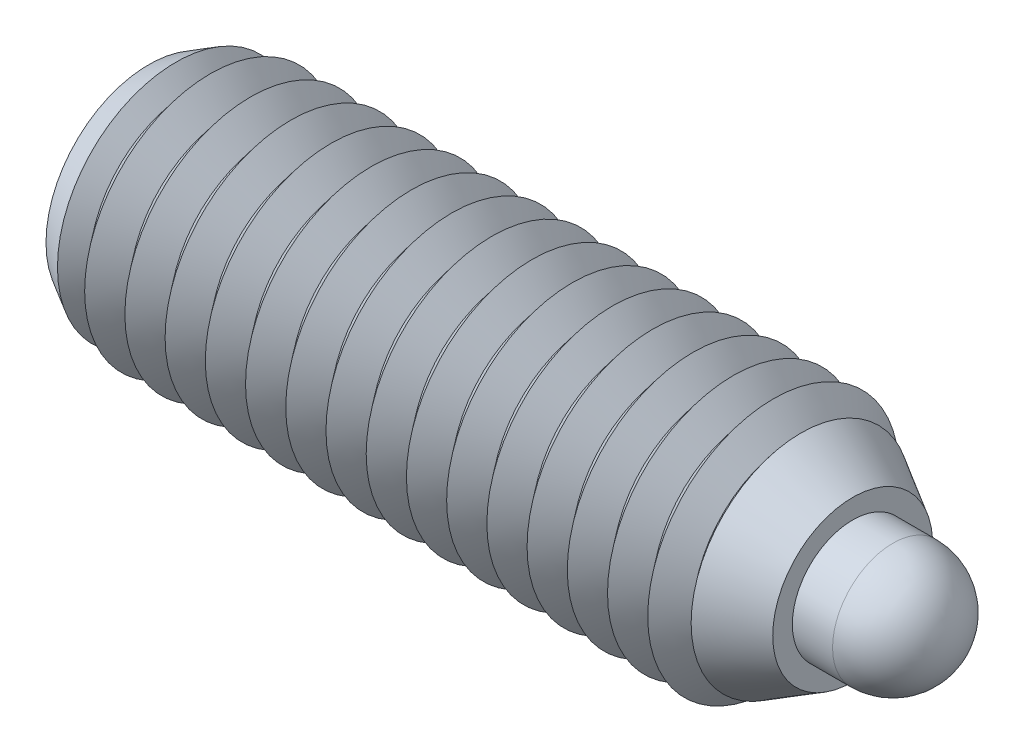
ISO-10303-21;
HEADER;
FILE_DESCRIPTION(('STEP AP214'),'2;1');
FILE_NAME('part.step','',(''),(''),'','','');
FILE_SCHEMA(('AUTOMOTIVE_DESIGN { 1 0 10303 214 1 1 1 1 }'));
ENDSEC;
DATA;
#1=APPLICATION_CONTEXT('core data for automotive mechanical design processes');
#2=APPLICATION_PROTOCOL_DEFINITION('international standard','automotive_design',2000,#1);
#3=PRODUCT_CONTEXT('',#1,'mechanical');
#4=PRODUCT('Part','Part','',(#3));
#5=PRODUCT_RELATED_PRODUCT_CATEGORY('part','',(#4));
#6=PRODUCT_DEFINITION_FORMATION('','',#4);
#7=PRODUCT_DEFINITION_CONTEXT('part definition',#1,'design');
#8=PRODUCT_DEFINITION('design','',#6,#7);
#9=PRODUCT_DEFINITION_SHAPE('','',#8);
#10=(LENGTH_UNIT() NAMED_UNIT(*) SI_UNIT(.MILLI.,.METRE.));
#11=(NAMED_UNIT(*) PLANE_ANGLE_UNIT() SI_UNIT($,.RADIAN.));
#12=(NAMED_UNIT(*) SI_UNIT($,.STERADIAN.) SOLID_ANGLE_UNIT());
#13=UNCERTAINTY_MEASURE_WITH_UNIT(LENGTH_MEASURE(1.E-05),#10,'distance_accuracy_value','');
#14=(GEOMETRIC_REPRESENTATION_CONTEXT(3) GLOBAL_UNCERTAINTY_ASSIGNED_CONTEXT((#13)) GLOBAL_UNIT_ASSIGNED_CONTEXT((#10,
#11,#12)) REPRESENTATION_CONTEXT('',''));
#15=CARTESIAN_POINT('',(0.,0.,0.));
#16=DIRECTION('',(0.,0.,1.));
#17=DIRECTION('',(1.,0.,0.));
#18=AXIS2_PLACEMENT_3D('',#15,#16,#17);
#19=CARTESIAN_POINT('',(12.9,0.,0.));
#20=DIRECTION('',(-1.,0.,0.));
#21=DIRECTION('',(0.,0.,1.));
#22=AXIS2_PLACEMENT_3D('',#19,#20,#21);
#23=CYLINDRICAL_SURFACE('',#22,1.68);
#24=CARTESIAN_POINT('',(10.66,0.,0.));
#25=DIRECTION('',(1.,0.,0.));
#26=DIRECTION('',(0.,0.,-1.));
#27=AXIS2_PLACEMENT_3D('',#24,#25,#26);
#28=CIRCLE('',#27,1.68);
#29=CARTESIAN_POINT('',(10.66,0.,-1.68));
#30=VERTEX_POINT('',#29);
#31=EDGE_CURVE('P0_E21',#30,#30,#28,.T.);
#32=ORIENTED_EDGE('',*,*,#31,.T.);
#33=EDGE_LOOP('',(#32));
#34=FACE_BOUND('',#33,.T.);
#35=CARTESIAN_POINT('',(12.42,0.,0.));
#36=DIRECTION('',(1.,0.,0.));
#37=DIRECTION('',(0.,0.,-1.));
#38=AXIS2_PLACEMENT_3D('',#35,#36,#37);
#39=CIRCLE('',#38,1.68);
#40=CARTESIAN_POINT('',(12.42,0.,-1.68));
#41=VERTEX_POINT('',#40);
#42=EDGE_CURVE('P0_E25',#41,#41,#39,.F.);
#43=ORIENTED_EDGE('',*,*,#42,.T.);
#44=EDGE_LOOP('',(#43));
#45=FACE_BOUND('',#44,.T.);
#46=ADVANCED_FACE('P0_F14',(#34,#45),#23,.T.);
#47=CARTESIAN_POINT('',(10.1,0.,0.));
#48=DIRECTION('',(1.,0.,0.));
#49=DIRECTION('',(0.,0.,-1.));
#50=AXIS2_PLACEMENT_3D('',#47,#48,#49);
#51=PLANE('',#50);
#52=CARTESIAN_POINT('',(10.1,0.,0.));
#53=DIRECTION('',(1.,0.,0.));
#54=DIRECTION('',(0.,0.,-1.));
#55=AXIS2_PLACEMENT_3D('',#52,#53,#54);
#56=CIRCLE('',#55,1.52994845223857);
#57=CARTESIAN_POINT('',(10.1,0.,-1.52994845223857));
#58=VERTEX_POINT('',#57);
#59=EDGE_CURVE('P0_E10',#58,#58,#56,.F.);
#60=ORIENTED_EDGE('',*,*,#59,.T.);
#61=EDGE_LOOP('',(#60));
#62=FACE_BOUND('',#61,.T.);
#63=ADVANCED_FACE('P0_F43',(#62),#51,.F.);
#64=CARTESIAN_POINT('',(14.8,0.,0.));
#65=DIRECTION('',(-1.,0.,0.));
#66=DIRECTION('',(0.,0.,1.));
#67=AXIS2_PLACEMENT_3D('',#64,#65,#66);
#68=CYLINDRICAL_SURFACE('',#67,1.2);
#69=CARTESIAN_POINT('',(14.8,0.,0.));
#70=DIRECTION('',(1.,0.,0.));
#71=DIRECTION('',(0.,0.,-1.));
#72=AXIS2_PLACEMENT_3D('',#69,#70,#71);
#73=CIRCLE('',#72,1.2);
#74=CARTESIAN_POINT('',(14.8,0.,1.2));
#75=VERTEX_POINT('',#74);
#76=EDGE_CURVE('P0_E29',#75,#75,#73,.T.);
#77=CARTESIAN_POINT('',(12.9,0.,0.));
#78=DIRECTION('',(1.,0.,0.));
#79=DIRECTION('',(0.,0.,-1.));
#80=AXIS2_PLACEMENT_3D('',#77,#78,#79);
#81=CIRCLE('',#80,1.2);
#82=CARTESIAN_POINT('',(12.9,0.,1.2));
#83=VERTEX_POINT('',#82);
#84=EDGE_CURVE('P0_E32',#83,#83,#81,.T.);
#85=CARTESIAN_POINT('',(14.8,0.,1.2));
#86=CARTESIAN_POINT('',(14.7802083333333,0.,1.2));
#87=CARTESIAN_POINT('',(14.7604166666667,0.,1.2));
#88=CARTESIAN_POINT('',(14.7208333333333,0.,1.2));
#89=CARTESIAN_POINT('',(14.7010416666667,0.,1.2));
#90=CARTESIAN_POINT('',(14.6614583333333,0.,1.2));
#91=CARTESIAN_POINT('',(14.6416666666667,0.,1.2));
#92=CARTESIAN_POINT('',(14.6020833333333,0.,1.2));
#93=CARTESIAN_POINT('',(14.5822916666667,0.,1.2));
#94=CARTESIAN_POINT('',(14.5427083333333,0.,1.2));
#95=CARTESIAN_POINT('',(14.5229166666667,0.,1.2));
#96=CARTESIAN_POINT('',(14.4833333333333,0.,1.2));
#97=CARTESIAN_POINT('',(14.4635416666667,0.,1.2));
#98=CARTESIAN_POINT('',(14.4239583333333,0.,1.2));
#99=CARTESIAN_POINT('',(14.4041666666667,0.,1.2));
#100=CARTESIAN_POINT('',(14.3645833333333,0.,1.2));
#101=CARTESIAN_POINT('',(14.3447916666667,0.,1.2));
#102=CARTESIAN_POINT('',(14.3052083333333,0.,1.2));
#103=CARTESIAN_POINT('',(14.2854166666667,0.,1.2));
#104=CARTESIAN_POINT('',(14.2458333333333,0.,1.2));
#105=CARTESIAN_POINT('',(14.2260416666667,0.,1.2));
#106=CARTESIAN_POINT('',(14.1864583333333,0.,1.2));
#107=CARTESIAN_POINT('',(14.1666666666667,0.,1.2));
#108=CARTESIAN_POINT('',(14.1270833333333,0.,1.2));
#109=CARTESIAN_POINT('',(14.1072916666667,0.,1.2));
#110=CARTESIAN_POINT('',(14.0677083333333,0.,1.2));
#111=CARTESIAN_POINT('',(14.0479166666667,0.,1.2));
#112=CARTESIAN_POINT('',(14.0083333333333,0.,1.2));
#113=CARTESIAN_POINT('',(13.9885416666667,0.,1.2));
#114=CARTESIAN_POINT('',(13.9489583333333,0.,1.2));
#115=CARTESIAN_POINT('',(13.9291666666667,0.,1.2));
#116=CARTESIAN_POINT('',(13.8895833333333,0.,1.2));
#117=CARTESIAN_POINT('',(13.8697916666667,0.,1.2));
#118=CARTESIAN_POINT('',(13.8302083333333,0.,1.2));
#119=CARTESIAN_POINT('',(13.8104166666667,0.,1.2));
#120=CARTESIAN_POINT('',(13.7708333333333,0.,1.2));
#121=CARTESIAN_POINT('',(13.7510416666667,0.,1.2));
#122=CARTESIAN_POINT('',(13.7114583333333,0.,1.2));
#123=CARTESIAN_POINT('',(13.6916666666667,0.,1.2));
#124=CARTESIAN_POINT('',(13.6520833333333,0.,1.2));
#125=CARTESIAN_POINT('',(13.6322916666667,0.,1.2));
#126=CARTESIAN_POINT('',(13.5927083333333,0.,1.2));
#127=CARTESIAN_POINT('',(13.5729166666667,0.,1.2));
#128=CARTESIAN_POINT('',(13.5333333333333,0.,1.2));
#129=CARTESIAN_POINT('',(13.5135416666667,0.,1.2));
#130=CARTESIAN_POINT('',(13.4739583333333,0.,1.2));
#131=CARTESIAN_POINT('',(13.4541666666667,0.,1.2));
#132=CARTESIAN_POINT('',(13.4145833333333,0.,1.2));
#133=CARTESIAN_POINT('',(13.3947916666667,0.,1.2));
#134=CARTESIAN_POINT('',(13.3552083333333,0.,1.2));
#135=CARTESIAN_POINT('',(13.3354166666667,0.,1.2));
#136=CARTESIAN_POINT('',(13.2958333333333,0.,1.2));
#137=CARTESIAN_POINT('',(13.2760416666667,0.,1.2));
#138=CARTESIAN_POINT('',(13.2364583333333,0.,1.2));
#139=CARTESIAN_POINT('',(13.2166666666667,0.,1.2));
#140=CARTESIAN_POINT('',(13.1770833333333,0.,1.2));
#141=CARTESIAN_POINT('',(13.1572916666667,0.,1.2));
#142=CARTESIAN_POINT('',(13.1177083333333,0.,1.2));
#143=CARTESIAN_POINT('',(13.0979166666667,0.,1.2));
#144=CARTESIAN_POINT('',(13.0583333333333,0.,1.2));
#145=CARTESIAN_POINT('',(13.0385416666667,0.,1.2));
#146=CARTESIAN_POINT('',(12.9989583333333,0.,1.2));
#147=CARTESIAN_POINT('',(12.9791666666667,0.,1.2));
#148=CARTESIAN_POINT('',(12.9395833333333,0.,1.2));
#149=CARTESIAN_POINT('',(12.9197916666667,0.,1.2));
#150=CARTESIAN_POINT('',(12.9,0.,1.2));
#151=B_SPLINE_CURVE_WITH_KNOTS('',3,(#85,#86,#87,#88,#89,#90,#91,#92,#93,#94,#95,#96,#97,#98,
#99,#100,#101,#102,#103,#104,#105,#106,#107,#108,#109,#110,#111,#112,#113,#114,#115,#116,#117,
#118,#119,#120,#121,#122,#123,#124,#125,#126,#127,#128,#129,#130,#131,#132,#133,#134,#135,#136,
#137,#138,#139,#140,#141,#142,#143,#144,#145,#146,#147,#148,#149,#150),.UNSPECIFIED.,.F.,.F.,(4,
2,2,2,2,2,2,2,2,2,2,2,2,2,2,2,2,2,2,2,2,2,2,2,2,2,2,2,2,2,2,2,4),(0.,0.0593749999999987,
0.118749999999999,0.178124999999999,0.2375,0.296874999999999,0.356249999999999,
0.415624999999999,0.475,0.534374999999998,0.593749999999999,0.653124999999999,0.7125,0.771875,
0.831249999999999,0.890624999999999,0.95,1.009375,1.06875,1.128125,1.1875,1.246875,1.30625,
1.365625,1.425,1.484375,1.54375,1.603125,1.6625,1.721875,1.78125,1.840625,1.9),.UNSPECIFIED.);
#152=EDGE_CURVE('P0_BSEAM40',#75,#83,#151,.T.);
#153=ORIENTED_EDGE('',*,*,#76,.F.);
#154=ORIENTED_EDGE('',*,*,#84,.T.);
#155=ORIENTED_EDGE('',*,*,#152,.T.);
#156=ORIENTED_EDGE('',*,*,#152,.F.);
#157=EDGE_LOOP('',(#153,#155,#154,#156));
#158=FACE_BOUND('',#157,.T.);
#159=ADVANCED_FACE('P0_F40',(#158),#68,.T.);
#160=CARTESIAN_POINT('',(14.8,0.,0.));
#161=DIRECTION('',(-1.,0.,0.));
#162=DIRECTION('',(0.,1.,0.));
#163=AXIS2_PLACEMENT_3D('',#160,#161,#162);
#164=SPHERICAL_SURFACE('',#163,1.2);
#165=ORIENTED_EDGE('',*,*,#76,.T.);
#166=EDGE_LOOP('',(#165));
#167=FACE_BOUND('',#166,.T.);
#168=ADVANCED_FACE('P0_F38',(#167),#164,.T.);
#169=CARTESIAN_POINT('',(12.9,0.,0.));
#170=DIRECTION('',(-1.,0.,0.));
#171=DIRECTION('',(0.,0.,1.));
#172=AXIS2_PLACEMENT_3D('',#169,#170,#171);
#173=CONICAL_SURFACE('',#172,1.2,0.785398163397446);
#174=ORIENTED_EDGE('',*,*,#42,.F.);
#175=EDGE_LOOP('',(#174));
#176=FACE_BOUND('',#175,.T.);
#177=ORIENTED_EDGE('',*,*,#84,.F.);
#178=EDGE_LOOP('',(#177));
#179=FACE_BOUND('',#178,.T.);
#180=ADVANCED_FACE('P0_F47',(#176,#179),#173,.T.);
#181=CARTESIAN_POINT('',(10.66,0.,0.));
#182=DIRECTION('',(1.,0.,0.));
#183=DIRECTION('',(0.,0.,-1.));
#184=AXIS2_PLACEMENT_3D('',#181,#182,#183);
#185=CONICAL_SURFACE('',#184,1.68,0.261799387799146);
#186=ORIENTED_EDGE('',*,*,#59,.F.);
#187=EDGE_LOOP('',(#186));
#188=FACE_BOUND('',#187,.T.);
#189=ORIENTED_EDGE('',*,*,#31,.F.);
#190=EDGE_LOOP('',(#189));
#191=FACE_BOUND('',#190,.T.);
#192=ADVANCED_FACE('P0_F16',(#188,#191),#185,.T.);
#193=CLOSED_SHELL('',(#46,#63,#159,#168,#180,#192));
#194=MANIFOLD_SOLID_BREP('P0_B1',#193);
#195=CARTESIAN_POINT('',(14.,0.,0.));
#196=DIRECTION('',(-1.,0.,0.));
#197=DIRECTION('',(0.,0.,1.));
#198=AXIS2_PLACEMENT_3D('',#195,#196,#197);
#199=CONICAL_SURFACE('',#198,1.58999999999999,0.5235987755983);
#200=CARTESIAN_POINT('',(14.,0.,0.));
#201=DIRECTION('',(1.,0.,0.));
#202=DIRECTION('',(0.,0.,-1.));
#203=AXIS2_PLACEMENT_3D('',#200,#201,#202);
#204=CIRCLE('',#203,1.58999999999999);
#205=CARTESIAN_POINT('',(14.,0.,1.59));
#206=VERTEX_POINT('',#205);
#207=EDGE_CURVE('P1_E326',#206,#206,#204,.T.);
#208=CARTESIAN_POINT('',(12.9709357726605,0.,0.));
#209=DIRECTION('',(1.,0.,0.));
#210=DIRECTION('',(0.,0.,-1.));
#211=AXIS2_PLACEMENT_3D('',#208,#209,#210);
#212=CIRCLE('',#211,2.18413050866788);
#213=CARTESIAN_POINT('',(12.9709357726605,0.,2.18413050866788));
#214=VERTEX_POINT('',#213);
#215=EDGE_CURVE('P1_E330',#214,#214,#212,.T.);
#216=CARTESIAN_POINT('',(14.,0.,1.59));
#217=CARTESIAN_POINT('',(13.9892805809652,0.,1.59618885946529));
#218=CARTESIAN_POINT('',(13.9785611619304,0.,1.60237771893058));
#219=CARTESIAN_POINT('',(13.9571223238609,0.,1.61475543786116));
#220=CARTESIAN_POINT('',(13.9464029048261,0.,1.62094429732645));
#221=CARTESIAN_POINT('',(13.9249640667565,0.,1.63332201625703));
#222=CARTESIAN_POINT('',(13.9142446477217,0.,1.63951087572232));
#223=CARTESIAN_POINT('',(13.8928058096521,0.,1.6518885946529));
#224=CARTESIAN_POINT('',(13.8820863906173,0.,1.65807745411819));
#225=CARTESIAN_POINT('',(13.8606475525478,0.,1.67045517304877));
#226=CARTESIAN_POINT('',(13.849928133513,0.,1.67664403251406));
#227=CARTESIAN_POINT('',(13.8284892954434,0.,1.68902175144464));
#228=CARTESIAN_POINT('',(13.8177698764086,0.,1.69521061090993));
#229=CARTESIAN_POINT('',(13.7963310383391,0.,1.70758832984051));
#230=CARTESIAN_POINT('',(13.7856116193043,0.,1.7137771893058));
#231=CARTESIAN_POINT('',(13.7641727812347,0.,1.72615490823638));
#232=CARTESIAN_POINT('',(13.7534533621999,0.,1.73234376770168));
#233=CARTESIAN_POINT('',(13.7320145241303,0.,1.74472148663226));
#234=CARTESIAN_POINT('',(13.7212951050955,0.,1.75091034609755));
#235=CARTESIAN_POINT('',(13.699856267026,0.,1.76328806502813));
#236=CARTESIAN_POINT('',(13.6891368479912,0.,1.76947692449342));
#237=CARTESIAN_POINT('',(13.6676980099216,0.,1.781854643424));
#238=CARTESIAN_POINT('',(13.6569785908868,0.,1.78804350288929));
#239=CARTESIAN_POINT('',(13.6355397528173,0.,1.80042122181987));
#240=CARTESIAN_POINT('',(13.6248203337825,0.,1.80661008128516));
#241=CARTESIAN_POINT('',(13.6033814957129,0.,1.81898780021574));
#242=CARTESIAN_POINT('',(13.5926620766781,0.,1.82517665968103));
#243=CARTESIAN_POINT('',(13.5712232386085,0.,1.83755437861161));
#244=CARTESIAN_POINT('',(13.5605038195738,0.,1.8437432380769));
#245=CARTESIAN_POINT('',(13.5390649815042,0.,1.85612095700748));
#246=CARTESIAN_POINT('',(13.5283455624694,0.,1.86230981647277));
#247=CARTESIAN_POINT('',(13.5069067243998,0.,1.87468753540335));
#248=CARTESIAN_POINT('',(13.496187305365,0.,1.88087639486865));
#249=CARTESIAN_POINT('',(13.4747484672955,0.,1.89325411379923));
#250=CARTESIAN_POINT('',(13.4640290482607,0.,1.89944297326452));
#251=CARTESIAN_POINT('',(13.4425902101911,0.,1.9118206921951));
#252=CARTESIAN_POINT('',(13.4318707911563,0.,1.91800955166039));
#253=CARTESIAN_POINT('',(13.4104319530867,0.,1.93038727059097));
#254=CARTESIAN_POINT('',(13.399712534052,0.,1.93657613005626));
#255=CARTESIAN_POINT('',(13.3782736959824,0.,1.94895384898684));
#256=CARTESIAN_POINT('',(13.3675542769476,0.,1.95514270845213));
#257=CARTESIAN_POINT('',(13.346115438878,0.,1.96752042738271));
#258=CARTESIAN_POINT('',(13.3353960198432,0.,1.973709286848));
#259=CARTESIAN_POINT('',(13.3139571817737,0.,1.98608700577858));
#260=CARTESIAN_POINT('',(13.3032377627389,0.,1.99227586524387));
#261=CARTESIAN_POINT('',(13.2817989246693,0.,2.00465358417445));
#262=CARTESIAN_POINT('',(13.2710795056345,0.,2.01084244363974));
#263=CARTESIAN_POINT('',(13.2496406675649,0.,2.02322016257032));
#264=CARTESIAN_POINT('',(13.2389212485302,0.,2.02940902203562));
#265=CARTESIAN_POINT('',(13.2174824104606,0.,2.0417867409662));
#266=CARTESIAN_POINT('',(13.2067629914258,0.,2.04797560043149));
#267=CARTESIAN_POINT('',(13.1853241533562,0.,2.06035331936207));
#268=CARTESIAN_POINT('',(13.1746047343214,0.,2.06654217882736));
#269=CARTESIAN_POINT('',(13.1531658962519,0.,2.07891989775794));
#270=CARTESIAN_POINT('',(13.1424464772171,0.,2.08510875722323));
#271=CARTESIAN_POINT('',(13.1210076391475,0.,2.09748647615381));
#272=CARTESIAN_POINT('',(13.1102882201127,0.,2.1036753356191));
#273=CARTESIAN_POINT('',(13.0888493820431,0.,2.11605305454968));
#274=CARTESIAN_POINT('',(13.0781299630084,0.,2.12224191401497));
#275=CARTESIAN_POINT('',(13.0566911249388,0.,2.13461963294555));
#276=CARTESIAN_POINT('',(13.045971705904,0.,2.14080849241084));
#277=CARTESIAN_POINT('',(13.0245328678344,0.,2.15318621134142));
#278=CARTESIAN_POINT('',(13.0138134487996,0.,2.15937507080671));
#279=CARTESIAN_POINT('',(12.9923746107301,0.,2.17175278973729));
#280=CARTESIAN_POINT('',(12.9816551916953,0.,2.17794164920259));
#281=CARTESIAN_POINT('',(12.9709357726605,0.,2.18413050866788));
#282=B_SPLINE_CURVE_WITH_KNOTS('',3,(#216,#217,#218,#219,#220,#221,#222,#223,#224,#225,#226,
#227,#228,#229,#230,#231,#232,#233,#234,#235,#236,#237,#238,#239,#240,#241,#242,#243,#244,#245,
#246,#247,#248,#249,#250,#251,#252,#253,#254,#255,#256,#257,#258,#259,#260,#261,#262,#263,#264,
#265,#266,#267,#268,#269,#270,#271,#272,#273,#274,#275,#276,#277,#278,#279,#280,#281),
.UNSPECIFIED.,.F.,.F.,(4,2,2,2,2,2,2,2,2,2,2,2,2,2,2,2,2,2,2,2,2,2,2,2,2,2,2,2,2,2,2,2,4),(0.,
0.0371331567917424,0.0742663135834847,0.111399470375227,0.148532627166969,0.185665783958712,
0.222798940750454,0.259932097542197,0.297065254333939,0.334198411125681,0.371331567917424,
0.408464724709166,0.445597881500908,0.482731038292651,0.519864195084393,0.556997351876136,
0.594130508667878,0.63126366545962,0.668396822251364,0.705529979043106,0.742663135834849,
0.779796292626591,0.816929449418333,0.854062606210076,0.891195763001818,0.92832891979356,
0.965462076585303,1.00259523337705,1.03972839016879,1.07686154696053,1.11399470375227,
1.15112786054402,1.18826101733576),.UNSPECIFIED.);
#283=EDGE_CURVE('P1_BSEAM15',#206,#214,#282,.T.);
#284=ORIENTED_EDGE('',*,*,#207,.F.);
#285=ORIENTED_EDGE('',*,*,#215,.T.);
#286=ORIENTED_EDGE('',*,*,#283,.T.);
#287=ORIENTED_EDGE('',*,*,#283,.F.);
#288=EDGE_LOOP('',(#284,#286,#285,#287));
#289=FACE_BOUND('',#288,.T.);
#290=ADVANCED_FACE('P1_F15',(#289),#199,.T.);
#291=CARTESIAN_POINT('',(14.,0.,0.));
#292=DIRECTION('',(1.,0.,0.));
#293=DIRECTION('',(0.,0.,-1.));
#294=AXIS2_PLACEMENT_3D('',#291,#292,#293);
#295=PLANE('',#294);
#296=ORIENTED_EDGE('',*,*,#207,.T.);
#297=EDGE_LOOP('',(#296));
#298=FACE_BOUND('',#297,.T.);
#299=CARTESIAN_POINT('',(14.,0.,0.));
#300=DIRECTION('',(1.,0.,0.));
#301=DIRECTION('',(0.,0.,-1.));
#302=AXIS2_PLACEMENT_3D('',#299,#300,#301);
#303=CIRCLE('',#302,1.2);
#304=CARTESIAN_POINT('',(14.,0.,-1.2));
#305=VERTEX_POINT('',#304);
#306=EDGE_CURVE('P1_E333',#305,#305,#303,.T.);
#307=ORIENTED_EDGE('',*,*,#306,.F.);
#308=EDGE_LOOP('',(#307));
#309=FACE_BOUND('',#308,.T.);
#310=ADVANCED_FACE('P1_F188',(#298,#309),#295,.T.);
#311=CARTESIAN_POINT('',(4.2,0.,0.));
#312=DIRECTION('',(-1.,0.,0.));
#313=DIRECTION('',(0.,0.,1.));
#314=AXIS2_PLACEMENT_3D('',#311,#312,#313);
#315=PLANE('',#314);
#316=CARTESIAN_POINT('',(4.2,0.,0.));
#317=DIRECTION('',(1.,0.,0.));
#318=DIRECTION('',(0.,0.,-1.));
#319=AXIS2_PLACEMENT_3D('',#316,#317,#318);
#320=CIRCLE('',#319,1.68);
#321=CARTESIAN_POINT('',(4.2,0.,-1.68));
#322=VERTEX_POINT('',#321);
#323=EDGE_CURVE('P1_E434',#322,#322,#320,.T.);
#324=ORIENTED_EDGE('',*,*,#323,.T.);
#325=EDGE_LOOP('',(#324));
#326=FACE_BOUND('',#325,.T.);
#327=ADVANCED_FACE('P1_F194',(#326),#315,.F.);
#328=CARTESIAN_POINT('',(14.,0.,0.));
#329=DIRECTION('',(1.,0.,0.));
#330=DIRECTION('',(0.,0.,-1.));
#331=AXIS2_PLACEMENT_3D('',#328,#329,#330);
#332=CYLINDRICAL_SURFACE('',#331,1.68);
#333=ORIENTED_EDGE('',*,*,#323,.F.);
#334=EDGE_LOOP('',(#333));
#335=FACE_BOUND('',#334,.T.);
#336=CARTESIAN_POINT('',(12.6,0.,0.));
#337=DIRECTION('',(1.,0.,0.));
#338=DIRECTION('',(0.,0.,-1.));
#339=AXIS2_PLACEMENT_3D('',#336,#337,#338);
#340=CIRCLE('',#339,1.68);
#341=CARTESIAN_POINT('',(12.6,0.,-1.68));
#342=VERTEX_POINT('',#341);
#343=EDGE_CURVE('P1_E432',#342,#342,#340,.T.);
#344=ORIENTED_EDGE('',*,*,#343,.T.);
#345=EDGE_LOOP('',(#344));
#346=FACE_BOUND('',#345,.T.);
#347=ADVANCED_FACE('P1_F765',(#335,#346),#332,.F.);
#348=CARTESIAN_POINT('',(14.,0.,0.));
#349=DIRECTION('',(-1.,0.,0.));
#350=DIRECTION('',(0.,0.,1.));
#351=AXIS2_PLACEMENT_3D('',#348,#349,#350);
#352=CONICAL_SURFACE('',#351,1.2,0.330297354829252);
#353=ORIENTED_EDGE('',*,*,#343,.F.);
#354=EDGE_LOOP('',(#353));
#355=FACE_BOUND('',#354,.T.);
#356=ORIENTED_EDGE('',*,*,#306,.T.);
#357=EDGE_LOOP('',(#356));
#358=FACE_BOUND('',#357,.T.);
#359=ADVANCED_FACE('P1_F757',(#355,#358),#352,.F.);
#360=CARTESIAN_POINT('',(12.8238337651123,0.,0.));
#361=DIRECTION('',(1.,0.,0.));
#362=DIRECTION('',(0.,0.,-1.));
#363=AXIS2_PLACEMENT_3D('',#360,#361,#362);
#364=CONICAL_SURFACE('',#363,2.00040016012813,0.895664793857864);
#365=ORIENTED_EDGE('',*,*,#215,.F.);
#366=EDGE_LOOP('',(#365));
#367=FACE_BOUND('',#366,.T.);
#368=CARTESIAN_POINT('',(12.8238337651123,0.,0.));
#369=DIRECTION('',(-1.,0.,0.));
#370=DIRECTION('',(0.,0.,1.));
#371=AXIS2_PLACEMENT_3D('',#368,#369,#370);
#372=CIRCLE('',#371,2.00040016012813);
#373=CARTESIAN_POINT('',(12.8238337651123,0.,2.00040016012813));
#374=VERTEX_POINT('',#373);
#375=EDGE_CURVE('P1_E334',#374,#374,#372,.T.);
#376=ORIENTED_EDGE('',*,*,#375,.F.);
#377=EDGE_LOOP('',(#376));
#378=FACE_BOUND('',#377,.T.);
#379=ADVANCED_FACE('P1_F749',(#367,#378),#364,.T.);
#380=CARTESIAN_POINT('',(12.4238337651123,0.,0.));
#381=DIRECTION('',(-1.,0.,0.));
#382=DIRECTION('',(0.,0.,1.));
#383=AXIS2_PLACEMENT_3D('',#380,#381,#382);
#384=CONICAL_SURFACE('',#383,2.5,0.895664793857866);
#385=ORIENTED_EDGE('',*,*,#375,.T.);
#386=EDGE_LOOP('',(#385));
#387=FACE_BOUND('',#386,.T.);
#388=CARTESIAN_POINT('',(12.4238337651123,0.,0.));
#389=DIRECTION('',(-1.,0.,0.));
#390=DIRECTION('',(0.,0.,1.));
#391=AXIS2_PLACEMENT_3D('',#388,#389,#390);
#392=CIRCLE('',#391,2.5);
#393=CARTESIAN_POINT('',(12.4238337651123,0.,2.5));
#394=VERTEX_POINT('',#393);
#395=EDGE_CURVE('P1_E425',#394,#394,#392,.T.);
#396=ORIENTED_EDGE('',*,*,#395,.F.);
#397=EDGE_LOOP('',(#396));
#398=FACE_BOUND('',#397,.T.);
#399=ADVANCED_FACE('P1_F741',(#387,#398),#384,.T.);
#400=CARTESIAN_POINT('',(12.0238337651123,0.,0.));
#401=DIRECTION('',(1.,0.,0.));
#402=DIRECTION('',(0.,0.,-1.));
#403=AXIS2_PLACEMENT_3D('',#400,#401,#402);
#404=CONICAL_SURFACE('',#403,2.00040016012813,0.895664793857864);
#405=ORIENTED_EDGE('',*,*,#395,.T.);
#406=EDGE_LOOP('',(#405));
#407=FACE_BOUND('',#406,.T.);
#408=CARTESIAN_POINT('',(12.0238337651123,0.,0.));
#409=DIRECTION('',(-1.,0.,0.));
#410=DIRECTION('',(0.,0.,1.));
#411=AXIS2_PLACEMENT_3D('',#408,#409,#410);
#412=CIRCLE('',#411,2.00040016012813);
#413=CARTESIAN_POINT('',(12.0238337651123,0.,2.00040016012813));
#414=VERTEX_POINT('',#413);
#415=EDGE_CURVE('P1_E422',#414,#414,#412,.T.);
#416=ORIENTED_EDGE('',*,*,#415,.F.);
#417=EDGE_LOOP('',(#416));
#418=FACE_BOUND('',#417,.T.);
#419=ADVANCED_FACE('P1_F733',(#407,#418),#404,.T.);
#420=CARTESIAN_POINT('',(11.6238337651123,0.,0.));
#421=DIRECTION('',(-1.,0.,0.));
#422=DIRECTION('',(0.,0.,1.));
#423=AXIS2_PLACEMENT_3D('',#420,#421,#422);
#424=CONICAL_SURFACE('',#423,2.5,0.895664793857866);
#425=ORIENTED_EDGE('',*,*,#415,.T.);
#426=EDGE_LOOP('',(#425));
#427=FACE_BOUND('',#426,.T.);
#428=CARTESIAN_POINT('',(11.6238337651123,0.,0.));
#429=DIRECTION('',(-1.,0.,0.));
#430=DIRECTION('',(0.,0.,1.));
#431=AXIS2_PLACEMENT_3D('',#428,#429,#430);
#432=CIRCLE('',#431,2.5);
#433=CARTESIAN_POINT('',(11.6238337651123,0.,2.5));
#434=VERTEX_POINT('',#433);
#435=EDGE_CURVE('P1_E419',#434,#434,#432,.T.);
#436=ORIENTED_EDGE('',*,*,#435,.F.);
#437=EDGE_LOOP('',(#436));
#438=FACE_BOUND('',#437,.T.);
#439=ADVANCED_FACE('P1_F725',(#427,#438),#424,.T.);
#440=CARTESIAN_POINT('',(11.2238337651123,0.,0.));
#441=DIRECTION('',(1.,0.,0.));
#442=DIRECTION('',(0.,0.,-1.));
#443=AXIS2_PLACEMENT_3D('',#440,#441,#442);
#444=CONICAL_SURFACE('',#443,2.00040016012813,0.895664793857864);
#445=ORIENTED_EDGE('',*,*,#435,.T.);
#446=EDGE_LOOP('',(#445));
#447=FACE_BOUND('',#446,.T.);
#448=CARTESIAN_POINT('',(11.2238337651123,0.,0.));
#449=DIRECTION('',(-1.,0.,0.));
#450=DIRECTION('',(0.,0.,1.));
#451=AXIS2_PLACEMENT_3D('',#448,#449,#450);
#452=CIRCLE('',#451,2.00040016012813);
#453=CARTESIAN_POINT('',(11.2238337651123,0.,2.00040016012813));
#454=VERTEX_POINT('',#453);
#455=EDGE_CURVE('P1_E416',#454,#454,#452,.T.);
#456=ORIENTED_EDGE('',*,*,#455,.F.);
#457=EDGE_LOOP('',(#456));
#458=FACE_BOUND('',#457,.T.);
#459=ADVANCED_FACE('P1_F717',(#447,#458),#444,.T.);
#460=CARTESIAN_POINT('',(10.8238337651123,0.,0.));
#461=DIRECTION('',(-1.,0.,0.));
#462=DIRECTION('',(0.,0.,1.));
#463=AXIS2_PLACEMENT_3D('',#460,#461,#462);
#464=CONICAL_SURFACE('',#463,2.5,0.895664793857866);
#465=ORIENTED_EDGE('',*,*,#455,.T.);
#466=EDGE_LOOP('',(#465));
#467=FACE_BOUND('',#466,.T.);
#468=CARTESIAN_POINT('',(10.8238337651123,0.,0.));
#469=DIRECTION('',(-1.,0.,0.));
#470=DIRECTION('',(0.,0.,1.));
#471=AXIS2_PLACEMENT_3D('',#468,#469,#470);
#472=CIRCLE('',#471,2.5);
#473=CARTESIAN_POINT('',(10.8238337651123,0.,2.5));
#474=VERTEX_POINT('',#473);
#475=EDGE_CURVE('P1_E413',#474,#474,#472,.T.);
#476=ORIENTED_EDGE('',*,*,#475,.F.);
#477=EDGE_LOOP('',(#476));
#478=FACE_BOUND('',#477,.T.);
#479=ADVANCED_FACE('P1_F709',(#467,#478),#464,.T.);
#480=CARTESIAN_POINT('',(10.4238337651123,0.,0.));
#481=DIRECTION('',(1.,0.,0.));
#482=DIRECTION('',(0.,0.,-1.));
#483=AXIS2_PLACEMENT_3D('',#480,#481,#482);
#484=CONICAL_SURFACE('',#483,2.00040016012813,0.895664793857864);
#485=ORIENTED_EDGE('',*,*,#475,.T.);
#486=EDGE_LOOP('',(#485));
#487=FACE_BOUND('',#486,.T.);
#488=CARTESIAN_POINT('',(10.4238337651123,0.,0.));
#489=DIRECTION('',(-1.,0.,0.));
#490=DIRECTION('',(0.,0.,1.));
#491=AXIS2_PLACEMENT_3D('',#488,#489,#490);
#492=CIRCLE('',#491,2.00040016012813);
#493=CARTESIAN_POINT('',(10.4238337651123,0.,2.00040016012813));
#494=VERTEX_POINT('',#493);
#495=EDGE_CURVE('P1_E410',#494,#494,#492,.T.);
#496=ORIENTED_EDGE('',*,*,#495,.F.);
#497=EDGE_LOOP('',(#496));
#498=FACE_BOUND('',#497,.T.);
#499=ADVANCED_FACE('P1_F701',(#487,#498),#484,.T.);
#500=CARTESIAN_POINT('',(10.0238337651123,0.,0.));
#501=DIRECTION('',(-1.,0.,0.));
#502=DIRECTION('',(0.,0.,1.));
#503=AXIS2_PLACEMENT_3D('',#500,#501,#502);
#504=CONICAL_SURFACE('',#503,2.5,0.895664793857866);
#505=ORIENTED_EDGE('',*,*,#495,.T.);
#506=EDGE_LOOP('',(#505));
#507=FACE_BOUND('',#506,.T.);
#508=CARTESIAN_POINT('',(10.0238337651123,0.,0.));
#509=DIRECTION('',(-1.,0.,0.));
#510=DIRECTION('',(0.,0.,1.));
#511=AXIS2_PLACEMENT_3D('',#508,#509,#510);
#512=CIRCLE('',#511,2.5);
#513=CARTESIAN_POINT('',(10.0238337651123,0.,2.5));
#514=VERTEX_POINT('',#513);
#515=EDGE_CURVE('P1_E407',#514,#514,#512,.T.);
#516=ORIENTED_EDGE('',*,*,#515,.F.);
#517=EDGE_LOOP('',(#516));
#518=FACE_BOUND('',#517,.T.);
#519=ADVANCED_FACE('P1_F693',(#507,#518),#504,.T.);
#520=CARTESIAN_POINT('',(9.62383376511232,0.,0.));
#521=DIRECTION('',(1.,0.,0.));
#522=DIRECTION('',(0.,0.,-1.));
#523=AXIS2_PLACEMENT_3D('',#520,#521,#522);
#524=CONICAL_SURFACE('',#523,2.00040016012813,0.895664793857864);
#525=ORIENTED_EDGE('',*,*,#515,.T.);
#526=EDGE_LOOP('',(#525));
#527=FACE_BOUND('',#526,.T.);
#528=CARTESIAN_POINT('',(9.62383376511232,0.,0.));
#529=DIRECTION('',(-1.,0.,0.));
#530=DIRECTION('',(0.,0.,1.));
#531=AXIS2_PLACEMENT_3D('',#528,#529,#530);
#532=CIRCLE('',#531,2.00040016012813);
#533=CARTESIAN_POINT('',(9.62383376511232,0.,2.00040016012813));
#534=VERTEX_POINT('',#533);
#535=EDGE_CURVE('P1_E404',#534,#534,#532,.T.);
#536=ORIENTED_EDGE('',*,*,#535,.F.);
#537=EDGE_LOOP('',(#536));
#538=FACE_BOUND('',#537,.T.);
#539=ADVANCED_FACE('P1_F685',(#527,#538),#524,.T.);
#540=CARTESIAN_POINT('',(9.22383376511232,0.,0.));
#541=DIRECTION('',(-1.,0.,0.));
#542=DIRECTION('',(0.,0.,1.));
#543=AXIS2_PLACEMENT_3D('',#540,#541,#542);
#544=CONICAL_SURFACE('',#543,2.5,0.895664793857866);
#545=ORIENTED_EDGE('',*,*,#535,.T.);
#546=EDGE_LOOP('',(#545));
#547=FACE_BOUND('',#546,.T.);
#548=CARTESIAN_POINT('',(9.22383376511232,0.,0.));
#549=DIRECTION('',(-1.,0.,0.));
#550=DIRECTION('',(0.,0.,1.));
#551=AXIS2_PLACEMENT_3D('',#548,#549,#550);
#552=CIRCLE('',#551,2.5);
#553=CARTESIAN_POINT('',(9.22383376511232,0.,2.5));
#554=VERTEX_POINT('',#553);
#555=EDGE_CURVE('P1_E401',#554,#554,#552,.T.);
#556=ORIENTED_EDGE('',*,*,#555,.F.);
#557=EDGE_LOOP('',(#556));
#558=FACE_BOUND('',#557,.T.);
#559=ADVANCED_FACE('P1_F677',(#547,#558),#544,.T.);
#560=CARTESIAN_POINT('',(8.82383376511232,0.,0.));
#561=DIRECTION('',(1.,0.,0.));
#562=DIRECTION('',(0.,0.,-1.));
#563=AXIS2_PLACEMENT_3D('',#560,#561,#562);
#564=CONICAL_SURFACE('',#563,2.00040016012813,0.895664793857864);
#565=ORIENTED_EDGE('',*,*,#555,.T.);
#566=EDGE_LOOP('',(#565));
#567=FACE_BOUND('',#566,.T.);
#568=CARTESIAN_POINT('',(8.82383376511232,0.,0.));
#569=DIRECTION('',(-1.,0.,0.));
#570=DIRECTION('',(0.,0.,1.));
#571=AXIS2_PLACEMENT_3D('',#568,#569,#570);
#572=CIRCLE('',#571,2.00040016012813);
#573=CARTESIAN_POINT('',(8.82383376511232,0.,2.00040016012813));
#574=VERTEX_POINT('',#573);
#575=EDGE_CURVE('P1_E398',#574,#574,#572,.T.);
#576=ORIENTED_EDGE('',*,*,#575,.F.);
#577=EDGE_LOOP('',(#576));
#578=FACE_BOUND('',#577,.T.);
#579=ADVANCED_FACE('P1_F669',(#567,#578),#564,.T.);
#580=CARTESIAN_POINT('',(8.42383376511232,0.,0.));
#581=DIRECTION('',(-1.,0.,0.));
#582=DIRECTION('',(0.,0.,1.));
#583=AXIS2_PLACEMENT_3D('',#580,#581,#582);
#584=CONICAL_SURFACE('',#583,2.5,0.895664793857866);
#585=ORIENTED_EDGE('',*,*,#575,.T.);
#586=EDGE_LOOP('',(#585));
#587=FACE_BOUND('',#586,.T.);
#588=CARTESIAN_POINT('',(8.42383376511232,0.,0.));
#589=DIRECTION('',(-1.,0.,0.));
#590=DIRECTION('',(0.,0.,1.));
#591=AXIS2_PLACEMENT_3D('',#588,#589,#590);
#592=CIRCLE('',#591,2.5);
#593=CARTESIAN_POINT('',(8.42383376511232,0.,2.5));
#594=VERTEX_POINT('',#593);
#595=EDGE_CURVE('P1_E395',#594,#594,#592,.T.);
#596=ORIENTED_EDGE('',*,*,#595,.F.);
#597=EDGE_LOOP('',(#596));
#598=FACE_BOUND('',#597,.T.);
#599=ADVANCED_FACE('P1_F661',(#587,#598),#584,.T.);
#600=CARTESIAN_POINT('',(8.02383376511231,0.,0.));
#601=DIRECTION('',(1.,0.,0.));
#602=DIRECTION('',(0.,0.,-1.));
#603=AXIS2_PLACEMENT_3D('',#600,#601,#602);
#604=CONICAL_SURFACE('',#603,2.00040016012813,0.895664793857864);
#605=ORIENTED_EDGE('',*,*,#595,.T.);
#606=EDGE_LOOP('',(#605));
#607=FACE_BOUND('',#606,.T.);
#608=CARTESIAN_POINT('',(8.02383376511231,0.,0.));
#609=DIRECTION('',(-1.,0.,0.));
#610=DIRECTION('',(0.,0.,1.));
#611=AXIS2_PLACEMENT_3D('',#608,#609,#610);
#612=CIRCLE('',#611,2.00040016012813);
#613=CARTESIAN_POINT('',(8.02383376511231,0.,2.00040016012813));
#614=VERTEX_POINT('',#613);
#615=EDGE_CURVE('P1_E392',#614,#614,#612,.T.);
#616=ORIENTED_EDGE('',*,*,#615,.F.);
#617=EDGE_LOOP('',(#616));
#618=FACE_BOUND('',#617,.T.);
#619=ADVANCED_FACE('P1_F653',(#607,#618),#604,.T.);
#620=CARTESIAN_POINT('',(7.62383376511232,0.,0.));
#621=DIRECTION('',(-1.,0.,0.));
#622=DIRECTION('',(0.,0.,1.));
#623=AXIS2_PLACEMENT_3D('',#620,#621,#622);
#624=CONICAL_SURFACE('',#623,2.5,0.895664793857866);
#625=ORIENTED_EDGE('',*,*,#615,.T.);
#626=EDGE_LOOP('',(#625));
#627=FACE_BOUND('',#626,.T.);
#628=CARTESIAN_POINT('',(7.62383376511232,0.,0.));
#629=DIRECTION('',(-1.,0.,0.));
#630=DIRECTION('',(0.,0.,1.));
#631=AXIS2_PLACEMENT_3D('',#628,#629,#630);
#632=CIRCLE('',#631,2.5);
#633=CARTESIAN_POINT('',(7.62383376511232,0.,2.5));
#634=VERTEX_POINT('',#633);
#635=EDGE_CURVE('P1_E389',#634,#634,#632,.T.);
#636=ORIENTED_EDGE('',*,*,#635,.F.);
#637=EDGE_LOOP('',(#636));
#638=FACE_BOUND('',#637,.T.);
#639=ADVANCED_FACE('P1_F645',(#627,#638),#624,.T.);
#640=CARTESIAN_POINT('',(7.22383376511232,0.,0.));
#641=DIRECTION('',(1.,0.,0.));
#642=DIRECTION('',(0.,0.,-1.));
#643=AXIS2_PLACEMENT_3D('',#640,#641,#642);
#644=CONICAL_SURFACE('',#643,2.00040016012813,0.895664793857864);
#645=ORIENTED_EDGE('',*,*,#635,.T.);
#646=EDGE_LOOP('',(#645));
#647=FACE_BOUND('',#646,.T.);
#648=CARTESIAN_POINT('',(7.22383376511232,0.,0.));
#649=DIRECTION('',(-1.,0.,0.));
#650=DIRECTION('',(0.,0.,1.));
#651=AXIS2_PLACEMENT_3D('',#648,#649,#650);
#652=CIRCLE('',#651,2.00040016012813);
#653=CARTESIAN_POINT('',(7.22383376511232,0.,2.00040016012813));
#654=VERTEX_POINT('',#653);
#655=EDGE_CURVE('P1_E386',#654,#654,#652,.T.);
#656=ORIENTED_EDGE('',*,*,#655,.F.);
#657=EDGE_LOOP('',(#656));
#658=FACE_BOUND('',#657,.T.);
#659=ADVANCED_FACE('P1_F637',(#647,#658),#644,.T.);
#660=CARTESIAN_POINT('',(6.82383376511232,0.,0.));
#661=DIRECTION('',(-1.,0.,0.));
#662=DIRECTION('',(0.,0.,1.));
#663=AXIS2_PLACEMENT_3D('',#660,#661,#662);
#664=CONICAL_SURFACE('',#663,2.5,0.895664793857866);
#665=ORIENTED_EDGE('',*,*,#655,.T.);
#666=EDGE_LOOP('',(#665));
#667=FACE_BOUND('',#666,.T.);
#668=CARTESIAN_POINT('',(6.82383376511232,0.,0.));
#669=DIRECTION('',(-1.,0.,0.));
#670=DIRECTION('',(0.,0.,1.));
#671=AXIS2_PLACEMENT_3D('',#668,#669,#670);
#672=CIRCLE('',#671,2.5);
#673=CARTESIAN_POINT('',(6.82383376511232,0.,2.5));
#674=VERTEX_POINT('',#673);
#675=EDGE_CURVE('P1_E383',#674,#674,#672,.T.);
#676=ORIENTED_EDGE('',*,*,#675,.F.);
#677=EDGE_LOOP('',(#676));
#678=FACE_BOUND('',#677,.T.);
#679=ADVANCED_FACE('P1_F629',(#667,#678),#664,.T.);
#680=CARTESIAN_POINT('',(6.42383376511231,0.,0.));
#681=DIRECTION('',(1.,0.,0.));
#682=DIRECTION('',(0.,0.,-1.));
#683=AXIS2_PLACEMENT_3D('',#680,#681,#682);
#684=CONICAL_SURFACE('',#683,2.00040016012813,0.895664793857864);
#685=ORIENTED_EDGE('',*,*,#675,.T.);
#686=EDGE_LOOP('',(#685));
#687=FACE_BOUND('',#686,.T.);
#688=CARTESIAN_POINT('',(6.42383376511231,0.,0.));
#689=DIRECTION('',(-1.,0.,0.));
#690=DIRECTION('',(0.,0.,1.));
#691=AXIS2_PLACEMENT_3D('',#688,#689,#690);
#692=CIRCLE('',#691,2.00040016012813);
#693=CARTESIAN_POINT('',(6.42383376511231,0.,2.00040016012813));
#694=VERTEX_POINT('',#693);
#695=EDGE_CURVE('P1_E380',#694,#694,#692,.T.);
#696=ORIENTED_EDGE('',*,*,#695,.F.);
#697=EDGE_LOOP('',(#696));
#698=FACE_BOUND('',#697,.T.);
#699=ADVANCED_FACE('P1_F621',(#687,#698),#684,.T.);
#700=CARTESIAN_POINT('',(6.02383376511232,0.,0.));
#701=DIRECTION('',(-1.,0.,0.));
#702=DIRECTION('',(0.,0.,1.));
#703=AXIS2_PLACEMENT_3D('',#700,#701,#702);
#704=CONICAL_SURFACE('',#703,2.5,0.895664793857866);
#705=ORIENTED_EDGE('',*,*,#695,.T.);
#706=EDGE_LOOP('',(#705));
#707=FACE_BOUND('',#706,.T.);
#708=CARTESIAN_POINT('',(6.02383376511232,0.,0.));
#709=DIRECTION('',(-1.,0.,0.));
#710=DIRECTION('',(0.,0.,1.));
#711=AXIS2_PLACEMENT_3D('',#708,#709,#710);
#712=CIRCLE('',#711,2.5);
#713=CARTESIAN_POINT('',(6.02383376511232,0.,2.5));
#714=VERTEX_POINT('',#713);
#715=EDGE_CURVE('P1_E377',#714,#714,#712,.T.);
#716=ORIENTED_EDGE('',*,*,#715,.F.);
#717=EDGE_LOOP('',(#716));
#718=FACE_BOUND('',#717,.T.);
#719=ADVANCED_FACE('P1_F613',(#707,#718),#704,.T.);
#720=CARTESIAN_POINT('',(5.62383376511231,0.,0.));
#721=DIRECTION('',(1.,0.,0.));
#722=DIRECTION('',(0.,0.,-1.));
#723=AXIS2_PLACEMENT_3D('',#720,#721,#722);
#724=CONICAL_SURFACE('',#723,2.00040016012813,0.895664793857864);
#725=ORIENTED_EDGE('',*,*,#715,.T.);
#726=EDGE_LOOP('',(#725));
#727=FACE_BOUND('',#726,.T.);
#728=CARTESIAN_POINT('',(5.62383376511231,0.,0.));
#729=DIRECTION('',(-1.,0.,0.));
#730=DIRECTION('',(0.,0.,1.));
#731=AXIS2_PLACEMENT_3D('',#728,#729,#730);
#732=CIRCLE('',#731,2.00040016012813);
#733=CARTESIAN_POINT('',(5.62383376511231,0.,2.00040016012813));
#734=VERTEX_POINT('',#733);
#735=EDGE_CURVE('P1_E374',#734,#734,#732,.T.);
#736=ORIENTED_EDGE('',*,*,#735,.F.);
#737=EDGE_LOOP('',(#736));
#738=FACE_BOUND('',#737,.T.);
#739=ADVANCED_FACE('P1_F605',(#727,#738),#724,.T.);
#740=CARTESIAN_POINT('',(5.22383376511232,0.,0.));
#741=DIRECTION('',(-1.,0.,0.));
#742=DIRECTION('',(0.,0.,1.));
#743=AXIS2_PLACEMENT_3D('',#740,#741,#742);
#744=CONICAL_SURFACE('',#743,2.5,0.895664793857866);
#745=ORIENTED_EDGE('',*,*,#735,.T.);
#746=EDGE_LOOP('',(#745));
#747=FACE_BOUND('',#746,.T.);
#748=CARTESIAN_POINT('',(5.22383376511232,0.,0.));
#749=DIRECTION('',(-1.,0.,0.));
#750=DIRECTION('',(0.,0.,1.));
#751=AXIS2_PLACEMENT_3D('',#748,#749,#750);
#752=CIRCLE('',#751,2.5);
#753=CARTESIAN_POINT('',(5.22383376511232,0.,2.5));
#754=VERTEX_POINT('',#753);
#755=EDGE_CURVE('P1_E371',#754,#754,#752,.T.);
#756=ORIENTED_EDGE('',*,*,#755,.F.);
#757=EDGE_LOOP('',(#756));
#758=FACE_BOUND('',#757,.T.);
#759=ADVANCED_FACE('P1_F597',(#747,#758),#744,.T.);
#760=CARTESIAN_POINT('',(4.82383376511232,0.,0.));
#761=DIRECTION('',(1.,0.,0.));
#762=DIRECTION('',(0.,0.,-1.));
#763=AXIS2_PLACEMENT_3D('',#760,#761,#762);
#764=CONICAL_SURFACE('',#763,2.00040016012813,0.895664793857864);
#765=ORIENTED_EDGE('',*,*,#755,.T.);
#766=EDGE_LOOP('',(#765));
#767=FACE_BOUND('',#766,.T.);
#768=CARTESIAN_POINT('',(4.82383376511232,0.,0.));
#769=DIRECTION('',(-1.,0.,0.));
#770=DIRECTION('',(0.,0.,1.));
#771=AXIS2_PLACEMENT_3D('',#768,#769,#770);
#772=CIRCLE('',#771,2.00040016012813);
#773=CARTESIAN_POINT('',(4.82383376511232,0.,2.00040016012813));
#774=VERTEX_POINT('',#773);
#775=EDGE_CURVE('P1_E368',#774,#774,#772,.T.);
#776=ORIENTED_EDGE('',*,*,#775,.F.);
#777=EDGE_LOOP('',(#776));
#778=FACE_BOUND('',#777,.T.);
#779=ADVANCED_FACE('P1_F589',(#767,#778),#764,.T.);
#780=CARTESIAN_POINT('',(4.42383376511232,0.,0.));
#781=DIRECTION('',(-1.,0.,0.));
#782=DIRECTION('',(0.,0.,1.));
#783=AXIS2_PLACEMENT_3D('',#780,#781,#782);
#784=CONICAL_SURFACE('',#783,2.5,0.895664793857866);
#785=ORIENTED_EDGE('',*,*,#775,.T.);
#786=EDGE_LOOP('',(#785));
#787=FACE_BOUND('',#786,.T.);
#788=CARTESIAN_POINT('',(4.42383376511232,0.,0.));
#789=DIRECTION('',(-1.,0.,0.));
#790=DIRECTION('',(0.,0.,1.));
#791=AXIS2_PLACEMENT_3D('',#788,#789,#790);
#792=CIRCLE('',#791,2.5);
#793=CARTESIAN_POINT('',(4.42383376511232,0.,2.5));
#794=VERTEX_POINT('',#793);
#795=EDGE_CURVE('P1_E365',#794,#794,#792,.T.);
#796=ORIENTED_EDGE('',*,*,#795,.F.);
#797=EDGE_LOOP('',(#796));
#798=FACE_BOUND('',#797,.T.);
#799=ADVANCED_FACE('P1_F581',(#787,#798),#784,.T.);
#800=CARTESIAN_POINT('',(4.02383376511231,0.,0.));
#801=DIRECTION('',(1.,0.,0.));
#802=DIRECTION('',(0.,0.,-1.));
#803=AXIS2_PLACEMENT_3D('',#800,#801,#802);
#804=CONICAL_SURFACE('',#803,2.00040016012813,0.895664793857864);
#805=ORIENTED_EDGE('',*,*,#795,.T.);
#806=EDGE_LOOP('',(#805));
#807=FACE_BOUND('',#806,.T.);
#808=CARTESIAN_POINT('',(4.02383376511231,0.,0.));
#809=DIRECTION('',(-1.,0.,0.));
#810=DIRECTION('',(0.,0.,1.));
#811=AXIS2_PLACEMENT_3D('',#808,#809,#810);
#812=CIRCLE('',#811,2.00040016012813);
#813=CARTESIAN_POINT('',(4.02383376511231,0.,2.00040016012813));
#814=VERTEX_POINT('',#813);
#815=EDGE_CURVE('P1_E362',#814,#814,#812,.T.);
#816=ORIENTED_EDGE('',*,*,#815,.F.);
#817=EDGE_LOOP('',(#816));
#818=FACE_BOUND('',#817,.T.);
#819=ADVANCED_FACE('P1_F573',(#807,#818),#804,.T.);
#820=CARTESIAN_POINT('',(3.62383376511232,0.,0.));
#821=DIRECTION('',(-1.,0.,0.));
#822=DIRECTION('',(0.,0.,1.));
#823=AXIS2_PLACEMENT_3D('',#820,#821,#822);
#824=CONICAL_SURFACE('',#823,2.5,0.895664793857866);
#825=ORIENTED_EDGE('',*,*,#815,.T.);
#826=EDGE_LOOP('',(#825));
#827=FACE_BOUND('',#826,.T.);
#828=CARTESIAN_POINT('',(3.62383376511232,0.,0.));
#829=DIRECTION('',(-1.,0.,0.));
#830=DIRECTION('',(0.,0.,1.));
#831=AXIS2_PLACEMENT_3D('',#828,#829,#830);
#832=CIRCLE('',#831,2.5);
#833=CARTESIAN_POINT('',(3.62383376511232,0.,2.5));
#834=VERTEX_POINT('',#833);
#835=EDGE_CURVE('P1_E359',#834,#834,#832,.T.);
#836=ORIENTED_EDGE('',*,*,#835,.F.);
#837=EDGE_LOOP('',(#836));
#838=FACE_BOUND('',#837,.T.);
#839=ADVANCED_FACE('P1_F565',(#827,#838),#824,.T.);
#840=CARTESIAN_POINT('',(3.22383376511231,0.,0.));
#841=DIRECTION('',(1.,0.,0.));
#842=DIRECTION('',(0.,0.,-1.));
#843=AXIS2_PLACEMENT_3D('',#840,#841,#842);
#844=CONICAL_SURFACE('',#843,2.00040016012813,0.895664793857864);
#845=ORIENTED_EDGE('',*,*,#835,.T.);
#846=EDGE_LOOP('',(#845));
#847=FACE_BOUND('',#846,.T.);
#848=CARTESIAN_POINT('',(3.22383376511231,0.,0.));
#849=DIRECTION('',(-1.,0.,0.));
#850=DIRECTION('',(0.,0.,1.));
#851=AXIS2_PLACEMENT_3D('',#848,#849,#850);
#852=CIRCLE('',#851,2.00040016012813);
#853=CARTESIAN_POINT('',(3.22383376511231,0.,2.00040016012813));
#854=VERTEX_POINT('',#853);
#855=EDGE_CURVE('P1_E356',#854,#854,#852,.T.);
#856=ORIENTED_EDGE('',*,*,#855,.F.);
#857=EDGE_LOOP('',(#856));
#858=FACE_BOUND('',#857,.T.);
#859=ADVANCED_FACE('P1_F557',(#847,#858),#844,.T.);
#860=CARTESIAN_POINT('',(2.82383376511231,0.,0.));
#861=DIRECTION('',(-1.,0.,0.));
#862=DIRECTION('',(0.,0.,1.));
#863=AXIS2_PLACEMENT_3D('',#860,#861,#862);
#864=CONICAL_SURFACE('',#863,2.5,0.895664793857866);
#865=ORIENTED_EDGE('',*,*,#855,.T.);
#866=EDGE_LOOP('',(#865));
#867=FACE_BOUND('',#866,.T.);
#868=CARTESIAN_POINT('',(2.82383376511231,0.,0.));
#869=DIRECTION('',(-1.,0.,0.));
#870=DIRECTION('',(0.,0.,1.));
#871=AXIS2_PLACEMENT_3D('',#868,#869,#870);
#872=CIRCLE('',#871,2.5);
#873=CARTESIAN_POINT('',(2.82383376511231,0.,2.5));
#874=VERTEX_POINT('',#873);
#875=EDGE_CURVE('P1_E353',#874,#874,#872,.T.);
#876=ORIENTED_EDGE('',*,*,#875,.F.);
#877=EDGE_LOOP('',(#876));
#878=FACE_BOUND('',#877,.T.);
#879=ADVANCED_FACE('P1_F549',(#867,#878),#864,.T.);
#880=CARTESIAN_POINT('',(2.42383376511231,0.,0.));
#881=DIRECTION('',(1.,0.,0.));
#882=DIRECTION('',(0.,0.,-1.));
#883=AXIS2_PLACEMENT_3D('',#880,#881,#882);
#884=CONICAL_SURFACE('',#883,2.00040016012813,0.895664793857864);
#885=ORIENTED_EDGE('',*,*,#875,.T.);
#886=EDGE_LOOP('',(#885));
#887=FACE_BOUND('',#886,.T.);
#888=CARTESIAN_POINT('',(2.42383376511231,0.,0.));
#889=DIRECTION('',(-1.,0.,0.));
#890=DIRECTION('',(0.,0.,1.));
#891=AXIS2_PLACEMENT_3D('',#888,#889,#890);
#892=CIRCLE('',#891,2.00040016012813);
#893=CARTESIAN_POINT('',(2.42383376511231,0.,2.00040016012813));
#894=VERTEX_POINT('',#893);
#895=EDGE_CURVE('P1_E350',#894,#894,#892,.T.);
#896=ORIENTED_EDGE('',*,*,#895,.F.);
#897=EDGE_LOOP('',(#896));
#898=FACE_BOUND('',#897,.T.);
#899=ADVANCED_FACE('P1_F541',(#887,#898),#884,.T.);
#900=CARTESIAN_POINT('',(2.02383376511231,0.,0.));
#901=DIRECTION('',(-1.,0.,0.));
#902=DIRECTION('',(0.,0.,1.));
#903=AXIS2_PLACEMENT_3D('',#900,#901,#902);
#904=CONICAL_SURFACE('',#903,2.5,0.895664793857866);
#905=ORIENTED_EDGE('',*,*,#895,.T.);
#906=EDGE_LOOP('',(#905));
#907=FACE_BOUND('',#906,.T.);
#908=CARTESIAN_POINT('',(2.02383376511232,0.,0.));
#909=DIRECTION('',(-1.,0.,0.));
#910=DIRECTION('',(0.,0.,1.));
#911=AXIS2_PLACEMENT_3D('',#908,#909,#910);
#912=CIRCLE('',#911,2.5);
#913=CARTESIAN_POINT('',(2.02383376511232,0.,2.5));
#914=VERTEX_POINT('',#913);
#915=EDGE_CURVE('P1_E342',#914,#914,#912,.T.);
#916=ORIENTED_EDGE('',*,*,#915,.F.);
#917=EDGE_LOOP('',(#916));
#918=FACE_BOUND('',#917,.T.);
#919=ADVANCED_FACE('P1_F533',(#907,#918),#904,.T.);
#920=CARTESIAN_POINT('',(1.62383376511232,0.,0.));
#921=DIRECTION('',(1.,0.,0.));
#922=DIRECTION('',(0.,0.,-1.));
#923=AXIS2_PLACEMENT_3D('',#920,#921,#922);
#924=CONICAL_SURFACE('',#923,2.00040016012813,0.895664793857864);
#925=ORIENTED_EDGE('',*,*,#915,.T.);
#926=EDGE_LOOP('',(#925));
#927=FACE_BOUND('',#926,.T.);
#928=CARTESIAN_POINT('',(1.62383376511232,0.,0.));
#929=DIRECTION('',(-1.,0.,0.));
#930=DIRECTION('',(0.,0.,1.));
#931=AXIS2_PLACEMENT_3D('',#928,#929,#930);
#932=CIRCLE('',#931,2.00040016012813);
#933=CARTESIAN_POINT('',(1.62383376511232,0.,2.00040016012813));
#934=VERTEX_POINT('',#933);
#935=EDGE_CURVE('P1_E338',#934,#934,#932,.T.);
#936=ORIENTED_EDGE('',*,*,#935,.F.);
#937=EDGE_LOOP('',(#936));
#938=FACE_BOUND('',#937,.T.);
#939=ADVANCED_FACE('P1_F525',(#927,#938),#924,.T.);
#940=CARTESIAN_POINT('',(1.22383376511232,0.,0.));
#941=DIRECTION('',(-1.,0.,0.));
#942=DIRECTION('',(0.,0.,1.));
#943=AXIS2_PLACEMENT_3D('',#940,#941,#942);
#944=CONICAL_SURFACE('',#943,2.5,0.895664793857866);
#945=ORIENTED_EDGE('',*,*,#935,.T.);
#946=EDGE_LOOP('',(#945));
#947=FACE_BOUND('',#946,.T.);
#948=CARTESIAN_POINT('',(1.22383376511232,0.,0.));
#949=DIRECTION('',(-1.,0.,0.));
#950=DIRECTION('',(0.,0.,1.));
#951=AXIS2_PLACEMENT_3D('',#948,#949,#950);
#952=CIRCLE('',#951,2.5);
#953=CARTESIAN_POINT('',(1.22383376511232,0.,2.5));
#954=VERTEX_POINT('',#953);
#955=EDGE_CURVE('P1_E126',#954,#954,#952,.T.);
#956=ORIENTED_EDGE('',*,*,#955,.F.);
#957=EDGE_LOOP('',(#956));
#958=FACE_BOUND('',#957,.T.);
#959=ADVANCED_FACE('P1_F519',(#947,#958),#944,.T.);
#960=CARTESIAN_POINT('',(0.823833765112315,0.,0.));
#961=DIRECTION('',(1.,0.,0.));
#962=DIRECTION('',(0.,0.,-1.));
#963=AXIS2_PLACEMENT_3D('',#960,#961,#962);
#964=CONICAL_SURFACE('',#963,2.00040016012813,0.895664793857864);
#965=ORIENTED_EDGE('',*,*,#955,.T.);
#966=EDGE_LOOP('',(#965));
#967=FACE_BOUND('',#966,.T.);
#968=CARTESIAN_POINT('',(0.823833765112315,0.,0.));
#969=DIRECTION('',(-1.,0.,0.));
#970=DIRECTION('',(0.,0.,1.));
#971=AXIS2_PLACEMENT_3D('',#968,#969,#970);
#972=CIRCLE('',#971,2.00040016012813);
#973=CARTESIAN_POINT('',(0.823833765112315,0.,2.00040016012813));
#974=VERTEX_POINT('',#973);
#975=EDGE_CURVE('P1_E123',#974,#974,#972,.T.);
#976=ORIENTED_EDGE('',*,*,#975,.F.);
#977=EDGE_LOOP('',(#976));
#978=FACE_BOUND('',#977,.T.);
#979=ADVANCED_FACE('P1_F512',(#967,#978),#964,.T.);
#980=CARTESIAN_POINT('',(0.423833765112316,0.,0.));
#981=DIRECTION('',(-1.,0.,0.));
#982=DIRECTION('',(0.,0.,1.));
#983=AXIS2_PLACEMENT_3D('',#980,#981,#982);
#984=CONICAL_SURFACE('',#983,2.5,0.895664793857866);
#985=CARTESIAN_POINT('',(0.538981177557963,0.,0.));
#986=DIRECTION('',(-1.,0.,0.));
#987=DIRECTION('',(0.,0.,1.));
#988=AXIS2_PLACEMENT_3D('',#985,#986,#987);
#989=CIRCLE('',#988,2.35618092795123);
#990=CARTESIAN_POINT('',(0.538981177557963,0.,2.35618092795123));
#991=VERTEX_POINT('',#990);
#992=EDGE_CURVE('P1_E336',#991,#991,#989,.T.);
#993=ORIENTED_EDGE('',*,*,#992,.F.);
#994=EDGE_LOOP('',(#993));
#995=FACE_BOUND('',#994,.T.);
#996=ORIENTED_EDGE('',*,*,#975,.T.);
#997=EDGE_LOOP('',(#996));
#998=FACE_BOUND('',#997,.T.);
#999=ADVANCED_FACE('P1_F145',(#995,#998),#984,.T.);
#1000=CARTESIAN_POINT('',(0.,0.,0.));
#1001=DIRECTION('',(1.,0.,0.));
#1002=DIRECTION('',(0.,0.,-1.));
#1003=AXIS2_PLACEMENT_3D('',#1000,#1001,#1002);
#1004=PLANE('',#1003);
#1005=CARTESIAN_POINT('',(0.,0.,0.));
#1006=DIRECTION('',(1.,0.,0.));
#1007=DIRECTION('',(0.,0.,-1.));
#1008=AXIS2_PLACEMENT_3D('',#1005,#1006,#1007);
#1009=CIRCLE('',#1008,2.045);
#1010=CARTESIAN_POINT('',(0.,0.,-2.045));
#1011=VERTEX_POINT('',#1010);
#1012=EDGE_CURVE('P1_E249',#1011,#1011,#1009,.F.);
#1013=ORIENTED_EDGE('',*,*,#1012,.T.);
#1014=EDGE_LOOP('',(#1013));
#1015=FACE_BOUND('',#1014,.T.);
#1016=CARTESIAN_POINT('',(0.,0.,0.));
#1017=DIRECTION('',(1.,0.,0.));
#1018=DIRECTION('',(0.,0.,-1.));
#1019=AXIS2_PLACEMENT_3D('',#1016,#1017,#1018);
#1020=CIRCLE('',#1019,1.44337567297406);
#1021=CARTESIAN_POINT('',(0.,-0.721687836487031,-1.25));
#1022=VERTEX_POINT('',#1021);
#1023=CARTESIAN_POINT('',(0.,0.721687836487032,-1.25));
#1024=VERTEX_POINT('',#1023);
#1025=EDGE_CURVE('P1_E19',#1022,#1024,#1020,.T.);
#1026=ORIENTED_EDGE('',*,*,#1025,.T.);
#1027=CARTESIAN_POINT('',(0.,1.44337567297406,0.));
#1028=VERTEX_POINT('',#1027);
#1029=EDGE_CURVE('P1_E10',#1024,#1028,#1020,.T.);
#1030=ORIENTED_EDGE('',*,*,#1029,.T.);
#1031=CARTESIAN_POINT('',(0.,0.,0.));
#1032=DIRECTION('',(-1.,0.,0.));
#1033=DIRECTION('',(0.,0.,1.));
#1034=AXIS2_PLACEMENT_3D('',#1031,#1032,#1033);
#1035=CIRCLE('',#1034,1.44337567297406);
#1036=CARTESIAN_POINT('',(0.,0.721687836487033,1.25));
#1037=VERTEX_POINT('',#1036);
#1038=EDGE_CURVE('P1_E35',#1037,#1028,#1035,.T.);
#1039=ORIENTED_EDGE('',*,*,#1038,.F.);
#1040=CARTESIAN_POINT('',(0.,-0.721687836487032,1.25));
#1041=VERTEX_POINT('',#1040);
#1042=EDGE_CURVE('P1_E24',#1037,#1041,#1020,.T.);
#1043=ORIENTED_EDGE('',*,*,#1042,.T.);
#1044=CARTESIAN_POINT('',(0.,-1.44337567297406,0.));
#1045=VERTEX_POINT('',#1044);
#1046=EDGE_CURVE('P1_E250',#1041,#1045,#1020,.T.);
#1047=ORIENTED_EDGE('',*,*,#1046,.T.);
#1048=EDGE_CURVE('P1_E245',#1045,#1022,#1020,.T.);
#1049=ORIENTED_EDGE('',*,*,#1048,.T.);
#1050=EDGE_LOOP('',(#1026,#1030,#1039,#1043,#1047,#1049));
#1051=FACE_BOUND('',#1050,.T.);
#1052=ADVANCED_FACE('P1_F103',(#1015,#1051),#1004,.F.);
#1053=CARTESIAN_POINT('',(0.788083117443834,0.,0.));
#1054=DIRECTION('',(1.,0.,0.));
#1055=DIRECTION('',(0.,0.,-1.));
#1056=AXIS2_PLACEMENT_3D('',#1053,#1054,#1055);
#1057=CONICAL_SURFACE('',#1056,2.5,0.5235987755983);
#1058=ORIENTED_EDGE('',*,*,#1012,.F.);
#1059=EDGE_LOOP('',(#1058));
#1060=FACE_BOUND('',#1059,.T.);
#1061=ORIENTED_EDGE('',*,*,#992,.T.);
#1062=EDGE_LOOP('',(#1061));
#1063=FACE_BOUND('',#1062,.T.);
#1064=ADVANCED_FACE('P1_F17',(#1060,#1063),#1057,.T.);
#1065=CARTESIAN_POINT('',(0.,0.,0.));
#1066=DIRECTION('',(-1.,0.,0.));
#1067=DIRECTION('',(0.,0.,1.));
#1068=AXIS2_PLACEMENT_3D('',#1065,#1066,#1067);
#1069=CONICAL_SURFACE('',#1068,1.44337567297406,1.0471975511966);
#1070=ORIENTED_EDGE('',*,*,#1025,.F.);
#1071=CARTESIAN_POINT('',(-0.464794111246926,-1.86893140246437,-1.25));
#1072=CARTESIAN_POINT('',(-0.438896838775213,-1.81495202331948,-1.25));
#1073=CARTESIAN_POINT('',(-0.413268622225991,-1.7608412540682,-1.25));
#1074=CARTESIAN_POINT('',(-0.362702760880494,-1.65228662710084,-1.25));
#1075=CARTESIAN_POINT('',(-0.337765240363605,-1.59784271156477,-1.25));
#1076=CARTESIAN_POINT('',(-0.288593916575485,-1.48823931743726,-1.25));
#1077=CARTESIAN_POINT('',(-0.264365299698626,-1.43307750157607,-1.25));
#1078=CARTESIAN_POINT('',(-0.216995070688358,-1.32229188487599,-1.25));
#1079=CARTESIAN_POINT('',(-0.193853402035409,-1.2666681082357,-1.25));
#1080=CARTESIAN_POINT('',(-0.148354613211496,-1.15340083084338,-1.25));
#1081=CARTESIAN_POINT('',(-0.12603381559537,-1.09574254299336,-1.25));
#1082=CARTESIAN_POINT('',(-0.0832554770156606,-0.979741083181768,-1.25));
#1083=CARTESIAN_POINT('',(-0.0627981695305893,-0.921397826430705,-1.25));
#1084=CARTESIAN_POINT('',(-0.00508423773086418,-0.745435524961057,-1.25));
#1085=CARTESIAN_POINT('',(0.0286497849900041,-0.626561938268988,-1.25));
#1086=CARTESIAN_POINT('',(0.0677795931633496,-0.445873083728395,-1.25));
#1087=CARTESIAN_POINT('',(0.0789059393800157,-0.385304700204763,-1.25));
#1088=CARTESIAN_POINT('',(0.0965721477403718,-0.263486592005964,-1.25));
#1089=CARTESIAN_POINT('',(0.103112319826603,-0.202236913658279,-1.25));
#1090=CARTESIAN_POINT('',(0.111001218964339,-0.0801324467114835,-1.25));
#1091=CARTESIAN_POINT('',(0.112411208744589,-0.0192817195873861,-1.25));
#1092=CARTESIAN_POINT('',(0.110083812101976,0.102319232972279,-1.25));
#1093=CARTESIAN_POINT('',(0.106346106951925,0.163069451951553,-1.25));
#1094=CARTESIAN_POINT('',(0.0911019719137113,0.312961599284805,-1.25));
#1095=CARTESIAN_POINT('',(0.0767387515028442,0.401813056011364,-1.25));
#1096=CARTESIAN_POINT('',(0.0397001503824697,0.577788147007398,-1.25));
#1097=CARTESIAN_POINT('',(0.0170147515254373,0.664909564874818,-1.25));
#1098=CARTESIAN_POINT('',(-0.021737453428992,0.795209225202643,-1.25));
#1099=CARTESIAN_POINT('',(-0.0356229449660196,0.839061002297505,-1.25));
#1100=CARTESIAN_POINT('',(-0.0646784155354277,0.926308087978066,-1.25));
#1101=CARTESIAN_POINT('',(-0.0798475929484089,0.969703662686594,-1.25));
#1102=CARTESIAN_POINT('',(-0.111250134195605,1.05609633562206,-1.25));
#1103=CARTESIAN_POINT('',(-0.127483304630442,1.09909350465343,-1.25));
#1104=CARTESIAN_POINT('',(-0.160838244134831,1.18474903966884,-1.25));
#1105=CARTESIAN_POINT('',(-0.177960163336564,1.22740734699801,-1.25));
#1106=CARTESIAN_POINT('',(-0.222761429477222,1.33629459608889,-1.25));
#1107=CARTESIAN_POINT('',(-0.250969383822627,1.40230581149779,-1.25));
#1108=CARTESIAN_POINT('',(-0.308745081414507,1.53373213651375,-1.25));
#1109=CARTESIAN_POINT('',(-0.338312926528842,1.59914720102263,-1.25));
#1110=CARTESIAN_POINT('',(-0.428576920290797,1.7946968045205,-1.25));
#1111=CARTESIAN_POINT('',(-0.490824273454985,1.92411391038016,-1.25));
#1112=CARTESIAN_POINT('',(-0.617929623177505,2.18184246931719,-1.25));
#1113=CARTESIAN_POINT('',(-0.682790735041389,2.31015236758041,-1.25));
#1114=CARTESIAN_POINT('',(-0.814180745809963,2.56589305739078,-1.25));
#1115=CARTESIAN_POINT('',(-0.880709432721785,2.69332395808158,-1.25));
#1116=CARTESIAN_POINT('',(-1.00858200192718,2.93557826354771,-1.25));
#1117=CARTESIAN_POINT('',(-1.06982257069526,3.05045639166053,-1.25));
#1118=CARTESIAN_POINT('',(-1.19300148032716,3.27984311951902,-1.25));
#1119=CARTESIAN_POINT('',(-1.25493984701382,3.39435170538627,-1.25));
#1120=CARTESIAN_POINT('',(-1.37918115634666,3.62279327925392,-1.25));
#1121=CARTESIAN_POINT('',(-1.44148277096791,3.73672699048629,-1.25));
#1122=CARTESIAN_POINT('',(-1.56649149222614,3.96436406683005,-1.25));
#1123=CARTESIAN_POINT('',(-1.62919857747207,4.07806744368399,-1.25));
#1124=CARTESIAN_POINT('',(-1.6920543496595,4.19168806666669,-1.25));
#1125=B_SPLINE_CURVE_WITH_KNOTS('',3,(#1071,#1072,#1073,#1074,#1075,#1076,#1077,#1078,#1079,
#1080,#1081,#1082,#1083,#1084,#1085,#1086,#1087,#1088,#1089,#1090,#1091,#1092,#1093,#1094,#1095,
#1096,#1097,#1098,#1099,#1100,#1101,#1102,#1103,#1104,#1105,#1106,#1107,#1108,#1109,#1110,#1111,
#1112,#1113,#1114,#1115,#1116,#1117,#1118,#1119,#1120,#1121,#1122,#1123,#1124),.UNSPECIFIED.,
.F.,.F.,(4,2,2,2,2,2,2,2,2,2,2,2,2,2,2,2,2,2,2,2,2,2,2,2,2,2,4),(0.,0.179612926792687,
0.359257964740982,0.539992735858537,0.720718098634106,0.906167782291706,1.09164066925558,
1.46154014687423,1.64614554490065,1.8307384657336,2.01311967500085,2.19551217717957,
2.46497297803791,2.73475922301,2.87273702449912,3.01062929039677,3.14849656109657,
3.28638719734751,3.50172172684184,3.71707241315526,4.14784491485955,4.57914698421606,
5.01039449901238,5.40093821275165,5.79149642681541,6.18106124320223,6.57060567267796),.UNSPECIFIED.);
#1126=EDGE_CURVE('P1_E93',#1024,#1022,#1125,.F.);
#1127=ORIENTED_EDGE('',*,*,#1126,.F.);
#1128=EDGE_LOOP('',(#1070,#1127));
#1129=FACE_BOUND('',#1128,.T.);
#1130=ADVANCED_FACE('P1_F248',(#1129),#1069,.F.);
#1131=ORIENTED_EDGE('',*,*,#1048,.F.);
#1132=CARTESIAN_POINT('',(-6.66746660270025E-05,-0.721572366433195,-1.2502));
#1133=CARTESIAN_POINT('',(0.0182540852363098,-0.75328812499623,-1.19526669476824));
#1134=CARTESIAN_POINT('',(0.0349166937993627,-0.785277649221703,-1.13985921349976));
#1135=CARTESIAN_POINT('',(0.06400269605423,-0.849810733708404,-1.02808463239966));
#1136=CARTESIAN_POINT('',(0.0764157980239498,-0.882355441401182,-0.97171554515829));
#1137=CARTESIAN_POINT('',(0.0957403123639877,-0.947041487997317,-0.859676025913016));
#1138=CARTESIAN_POINT('',(0.102780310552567,-0.979172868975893,-0.804022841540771));
#1139=CARTESIAN_POINT('',(0.111187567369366,-1.04358696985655,-0.692454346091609));
#1140=CARTESIAN_POINT('',(0.112561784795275,-1.07586945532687,-0.6365394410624));
#1141=CARTESIAN_POINT('',(0.10971666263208,-1.13620103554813,-0.532042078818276));
#1142=CARTESIAN_POINT('',(0.106195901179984,-1.16425912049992,-0.483444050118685));
#1143=CARTESIAN_POINT('',(0.0950328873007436,-1.22019247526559,-0.386564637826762));
#1144=CARTESIAN_POINT('',(0.0873868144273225,-1.24806755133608,-0.338283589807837));
#1145=CARTESIAN_POINT('',(0.0682705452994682,-1.30411641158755,-0.241204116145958));
#1146=CARTESIAN_POINT('',(0.0567192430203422,-1.33228309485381,-0.192417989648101));
#1147=CARTESIAN_POINT('',(0.0305016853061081,-1.38819614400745,-0.0955737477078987));
#1148=CARTESIAN_POINT('',(0.0158415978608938,-1.41594322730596,-0.0475143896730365));
#1149=CARTESIAN_POINT('',(-6.66746660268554E-05,-1.4434911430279,0.000199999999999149));
#1150=B_SPLINE_CURVE_WITH_KNOTS('',3,(#1132,#1133,#1134,#1135,#1136,#1137,#1138,#1139,#1140,
#1141,#1142,#1143,#1144,#1145,#1146,#1147,#1148,#1149),.UNSPECIFIED.,.F.,.F.,(4,2,2,2,2,2,2,2,
4),(0.,0.198150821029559,0.396778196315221,0.5904886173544,0.783961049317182,0.952480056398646,
1.1211553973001,1.2935743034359,1.4656542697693),.UNSPECIFIED.);
#1151=EDGE_CURVE('P1_E163',#1022,#1045,#1150,.T.);
#1152=ORIENTED_EDGE('',*,*,#1151,.F.);
#1153=EDGE_LOOP('',(#1131,#1152));
#1154=FACE_BOUND('',#1153,.T.);
#1155=ADVANCED_FACE('P1_F244',(#1154),#1069,.F.);
#1156=ORIENTED_EDGE('',*,*,#1046,.F.);
#1157=CARTESIAN_POINT('',(-6.66746660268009E-05,-1.4434911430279,-0.000200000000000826));
#1158=CARTESIAN_POINT('',(0.01825408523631,-1.41177538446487,0.0547333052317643));
#1159=CARTESIAN_POINT('',(0.034916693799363,-1.37978586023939,0.110140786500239));
#1160=CARTESIAN_POINT('',(0.0640026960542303,-1.31525277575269,0.221915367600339));
#1161=CARTESIAN_POINT('',(0.0764157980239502,-1.28270806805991,0.278284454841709));
#1162=CARTESIAN_POINT('',(0.0957403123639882,-1.21802202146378,0.390323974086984));
#1163=CARTESIAN_POINT('',(0.102780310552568,-1.1858906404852,0.445977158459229));
#1164=CARTESIAN_POINT('',(0.111187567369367,-1.12147653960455,0.557545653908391));
#1165=CARTESIAN_POINT('',(0.112561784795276,-1.08919405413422,0.613460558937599));
#1166=CARTESIAN_POINT('',(0.10971666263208,-1.02886247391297,0.717957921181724));
#1167=CARTESIAN_POINT('',(0.106195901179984,-1.00080438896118,0.766555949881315));
#1168=CARTESIAN_POINT('',(0.0950328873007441,-0.944871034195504,0.863435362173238));
#1169=CARTESIAN_POINT('',(0.087386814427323,-0.91699595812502,0.911716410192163));
#1170=CARTESIAN_POINT('',(0.0682705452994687,-0.860947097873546,1.00879588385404));
#1171=CARTESIAN_POINT('',(0.0567192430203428,-0.83278041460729,1.0575820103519));
#1172=CARTESIAN_POINT('',(0.0305016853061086,-0.776867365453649,1.1544262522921));
#1173=CARTESIAN_POINT('',(0.0158415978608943,-0.74912028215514,1.20248561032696));
#1174=CARTESIAN_POINT('',(-6.66746660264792E-05,-0.721572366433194,1.2502));
#1175=B_SPLINE_CURVE_WITH_KNOTS('',3,(#1157,#1158,#1159,#1160,#1161,#1162,#1163,#1164,#1165,
#1166,#1167,#1168,#1169,#1170,#1171,#1172,#1173,#1174),.UNSPECIFIED.,.F.,.F.,(4,2,2,2,2,2,2,2,
4),(0.,0.198150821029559,0.396778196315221,0.5904886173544,0.783961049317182,0.952480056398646,
1.1211553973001,1.2935743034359,1.4656542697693),.UNSPECIFIED.);
#1176=EDGE_CURVE('P1_E156',#1045,#1041,#1175,.T.);
#1177=ORIENTED_EDGE('',*,*,#1176,.F.);
#1178=EDGE_LOOP('',(#1156,#1177));
#1179=FACE_BOUND('',#1178,.T.);
#1180=ADVANCED_FACE('P1_F252',(#1179),#1069,.F.);
#1181=ORIENTED_EDGE('',*,*,#1042,.F.);
#1182=CARTESIAN_POINT('',(-0.464794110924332,-1.86893140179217,1.25));
#1183=CARTESIAN_POINT('',(-0.438896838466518,-1.81495202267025,1.25));
#1184=CARTESIAN_POINT('',(-0.413268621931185,-1.76084125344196,1.25));
#1185=CARTESIAN_POINT('',(-0.362702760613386,-1.65228662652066,1.25));
#1186=CARTESIAN_POINT('',(-0.337765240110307,-1.59784271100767,1.25));
#1187=CARTESIAN_POINT('',(-0.288593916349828,-1.48823931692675,1.25));
#1188=CARTESIAN_POINT('',(-0.264365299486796,-1.43307750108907,1.25));
#1189=CARTESIAN_POINT('',(-0.21699507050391,-1.3222918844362,1.25));
#1190=CARTESIAN_POINT('',(-0.193853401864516,-1.26666810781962,1.25));
#1191=CARTESIAN_POINT('',(-0.148354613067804,-1.15340083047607,1.25));
#1192=CARTESIAN_POINT('',(-0.1260338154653,-1.09574254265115,1.25));
#1193=CARTESIAN_POINT('',(-0.0832554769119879,-0.979741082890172,1.25));
#1194=CARTESIAN_POINT('',(-0.0627981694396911,-0.921397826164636,1.25));
#1195=CARTESIAN_POINT('',(-0.00508423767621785,-0.745435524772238,1.25));
#1196=CARTESIAN_POINT('',(0.0286497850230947,-0.626561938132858,1.25));
#1197=CARTESIAN_POINT('',(0.0677795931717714,-0.445873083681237,1.25));
#1198=CARTESIAN_POINT('',(0.0789059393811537,-0.385304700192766,1.25));
#1199=CARTESIAN_POINT('',(0.0965721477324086,-0.263486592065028,1.25));
#1200=CARTESIAN_POINT('',(0.103112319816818,-0.202236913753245,1.25));
#1201=CARTESIAN_POINT('',(0.111001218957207,-0.0801324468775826,1.25));
#1202=CARTESIAN_POINT('',(0.112411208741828,-0.0192817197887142,1.25));
#1203=CARTESIAN_POINT('',(0.110083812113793,0.102319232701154,1.25));
#1204=CARTESIAN_POINT('',(0.106346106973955,0.163069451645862,1.25));
#1205=CARTESIAN_POINT('',(0.0911019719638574,0.312961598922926,1.25));
#1206=CARTESIAN_POINT('',(0.0767387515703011,0.401813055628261,1.25));
#1207=CARTESIAN_POINT('',(0.03970015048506,0.5777881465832,1.25));
#1208=CARTESIAN_POINT('',(0.0170147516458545,0.66490956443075,1.25));
#1209=CARTESIAN_POINT('',(-0.0217374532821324,0.795209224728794,1.25));
#1210=CARTESIAN_POINT('',(-0.035622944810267,0.839061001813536,1.25));
#1211=CARTESIAN_POINT('',(-0.064678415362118,0.926308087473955,1.25));
#1212=CARTESIAN_POINT('',(-0.079847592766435,0.969703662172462,1.25));
#1213=CARTESIAN_POINT('',(-0.111250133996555,1.05609633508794,1.25));
#1214=CARTESIAN_POINT('',(-0.12748330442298,1.09909350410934,1.25));
#1215=CARTESIAN_POINT('',(-0.16083824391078,1.1847490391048,1.25));
#1216=CARTESIAN_POINT('',(-0.177960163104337,1.22740734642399,1.25));
#1217=CARTESIAN_POINT('',(-0.22276142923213,1.33629459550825,1.25));
#1218=CARTESIAN_POINT('',(-0.250969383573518,1.40230581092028,1.25));
#1219=CARTESIAN_POINT('',(-0.308745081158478,1.53373213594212,1.25));
#1220=CARTESIAN_POINT('',(-0.338312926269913,1.59914720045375,1.25));
#1221=CARTESIAN_POINT('',(-0.428576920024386,1.79469680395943,1.25));
#1222=CARTESIAN_POINT('',(-0.490824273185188,1.92411390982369,1.25));
#1223=CARTESIAN_POINT('',(-0.617929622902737,2.18184246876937,1.25));
#1224=CARTESIAN_POINT('',(-0.682790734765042,2.31015236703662,1.25));
#1225=CARTESIAN_POINT('',(-0.814180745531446,2.56589305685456,1.25));
#1226=CARTESIAN_POINT('',(-0.880709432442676,2.69332395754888,1.25));
#1227=CARTESIAN_POINT('',(-1.00858200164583,2.93557826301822,1.25));
#1228=CARTESIAN_POINT('',(-1.06982257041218,3.05045639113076,1.25));
#1229=CARTESIAN_POINT('',(-1.19300148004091,3.27984311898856,1.25));
#1230=CARTESIAN_POINT('',(-1.25493984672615,3.39435170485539,1.25));
#1231=CARTESIAN_POINT('',(-1.37918115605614,3.62279327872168,1.25));
#1232=CARTESIAN_POINT('',(-1.44148277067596,3.73672698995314,1.25));
#1233=CARTESIAN_POINT('',(-1.56649149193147,3.96436406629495,1.25));
#1234=CARTESIAN_POINT('',(-1.62919857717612,4.07806744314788,1.25));
#1235=CARTESIAN_POINT('',(-1.69205434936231,4.19168806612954,1.25));
#1236=B_SPLINE_CURVE_WITH_KNOTS('',3,(#1182,#1183,#1184,#1185,#1186,#1187,#1188,#1189,#1190,
#1191,#1192,#1193,#1194,#1195,#1196,#1197,#1198,#1199,#1200,#1201,#1202,#1203,#1204,#1205,#1206,
#1207,#1208,#1209,#1210,#1211,#1212,#1213,#1214,#1215,#1216,#1217,#1218,#1219,#1220,#1221,#1222,
#1223,#1224,#1225,#1226,#1227,#1228,#1229,#1230,#1231,#1232,#1233,#1234,#1235),.UNSPECIFIED.,
.F.,.F.,(4,2,2,2,2,2,2,2,2,2,2,2,2,2,2,2,2,2,2,2,2,2,2,2,2,2,4),(0.,0.179612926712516,
0.359257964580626,0.53999273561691,0.720718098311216,0.90616778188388,1.09164066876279,
1.4615401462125,1.64614554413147,1.83073846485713,2.01311967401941,2.19551217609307,
2.46497297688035,2.73475922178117,2.87273702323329,3.01062928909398,3.14849655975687,
3.28638719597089,3.50172172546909,3.7170724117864,4.14784491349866,4.57914698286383,
5.0103944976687,5.40093821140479,5.7914964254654,6.18106124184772,6.57060567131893),.UNSPECIFIED.);
#1237=EDGE_CURVE('P1_E100',#1041,#1037,#1236,.T.);
#1238=ORIENTED_EDGE('',*,*,#1237,.F.);
#1239=EDGE_LOOP('',(#1181,#1238));
#1240=FACE_BOUND('',#1239,.T.);
#1241=ADVANCED_FACE('P1_F144',(#1240),#1069,.F.);
#1242=ORIENTED_EDGE('',*,*,#1038,.T.);
#1243=CARTESIAN_POINT('',(-6.66746660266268E-05,0.721572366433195,1.2502));
#1244=CARTESIAN_POINT('',(0.0182540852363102,0.75328812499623,1.19526669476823));
#1245=CARTESIAN_POINT('',(0.0349166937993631,0.785277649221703,1.13985921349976));
#1246=CARTESIAN_POINT('',(0.0640026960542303,0.849810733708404,1.02808463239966));
#1247=CARTESIAN_POINT('',(0.07641579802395,0.882355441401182,0.97171554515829));
#1248=CARTESIAN_POINT('',(0.0957403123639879,0.947041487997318,0.859676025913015));
#1249=CARTESIAN_POINT('',(0.102780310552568,0.979172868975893,0.80402284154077));
#1250=CARTESIAN_POINT('',(0.111187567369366,1.04358696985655,0.692454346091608));
#1251=CARTESIAN_POINT('',(0.112561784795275,1.07586945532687,0.6365394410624));
#1252=CARTESIAN_POINT('',(0.10971666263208,1.13620103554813,0.532042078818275));
#1253=CARTESIAN_POINT('',(0.106195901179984,1.16425912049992,0.483444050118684));
#1254=CARTESIAN_POINT('',(0.0950328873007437,1.22019247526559,0.386564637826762));
#1255=CARTESIAN_POINT('',(0.0873868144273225,1.24806755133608,0.338283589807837));
#1256=CARTESIAN_POINT('',(0.0682705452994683,1.30411641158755,0.241204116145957));
#1257=CARTESIAN_POINT('',(0.0567192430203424,1.33228309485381,0.192417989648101));
#1258=CARTESIAN_POINT('',(0.0305016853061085,1.38819614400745,0.0955737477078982));
#1259=CARTESIAN_POINT('',(0.0158415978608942,1.41594322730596,0.047514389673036));
#1260=CARTESIAN_POINT('',(-6.66746660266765E-05,1.4434911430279,-0.000199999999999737));
#1261=B_SPLINE_CURVE_WITH_KNOTS('',3,(#1243,#1244,#1245,#1246,#1247,#1248,#1249,#1250,#1251,
#1252,#1253,#1254,#1255,#1256,#1257,#1258,#1259,#1260),.UNSPECIFIED.,.F.,.F.,(4,2,2,2,2,2,2,2,
4),(0.,0.198150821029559,0.396778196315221,0.590488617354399,0.783961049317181,
0.952480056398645,1.1211553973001,1.2935743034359,1.4656542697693),.UNSPECIFIED.);
#1262=EDGE_CURVE('P1_E92',#1037,#1028,#1261,.T.);
#1263=ORIENTED_EDGE('',*,*,#1262,.F.);
#1264=EDGE_LOOP('',(#1242,#1263));
#1265=FACE_BOUND('',#1264,.T.);
#1266=ADVANCED_FACE('P1_F97',(#1265),#1069,.F.);
#1267=ORIENTED_EDGE('',*,*,#1029,.F.);
#1268=CARTESIAN_POINT('',(-6.66746660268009E-05,1.4434911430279,0.000200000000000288));
#1269=CARTESIAN_POINT('',(0.0182540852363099,1.41177538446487,-0.0547333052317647));
#1270=CARTESIAN_POINT('',(0.0349166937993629,1.37978586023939,-0.110140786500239));
#1271=CARTESIAN_POINT('',(0.0640026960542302,1.31525277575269,-0.22191536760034));
#1272=CARTESIAN_POINT('',(0.07641579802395,1.28270806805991,-0.27828445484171));
#1273=CARTESIAN_POINT('',(0.0957403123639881,1.21802202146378,-0.390323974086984));
#1274=CARTESIAN_POINT('',(0.102780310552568,1.1858906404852,-0.445977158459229));
#1275=CARTESIAN_POINT('',(0.111187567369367,1.12147653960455,-0.557545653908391));
#1276=CARTESIAN_POINT('',(0.112561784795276,1.08919405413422,-0.6134605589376));
#1277=CARTESIAN_POINT('',(0.10971666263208,1.02886247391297,-0.717957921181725));
#1278=CARTESIAN_POINT('',(0.106195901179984,1.00080438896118,-0.766555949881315));
#1279=CARTESIAN_POINT('',(0.0950328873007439,0.944871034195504,-0.863435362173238));
#1280=CARTESIAN_POINT('',(0.0873868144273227,0.91699595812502,-0.911716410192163));
#1281=CARTESIAN_POINT('',(0.0682705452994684,0.860947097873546,-1.00879588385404));
#1282=CARTESIAN_POINT('',(0.0567192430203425,0.83278041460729,-1.0575820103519));
#1283=CARTESIAN_POINT('',(0.0305016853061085,0.776867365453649,-1.1544262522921));
#1284=CARTESIAN_POINT('',(0.0158415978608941,0.74912028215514,-1.20248561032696));
#1285=CARTESIAN_POINT('',(-6.6674666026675E-05,0.721572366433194,-1.2502));
#1286=B_SPLINE_CURVE_WITH_KNOTS('',3,(#1268,#1269,#1270,#1271,#1272,#1273,#1274,#1275,#1276,
#1277,#1278,#1279,#1280,#1281,#1282,#1283,#1284,#1285),.UNSPECIFIED.,.F.,.F.,(4,2,2,2,2,2,2,2,
4),(0.,0.198150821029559,0.396778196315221,0.5904886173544,0.783961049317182,0.952480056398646,
1.1211553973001,1.2935743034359,1.4656542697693),.UNSPECIFIED.);
#1287=EDGE_CURVE('P1_E87',#1028,#1024,#1286,.T.);
#1288=ORIENTED_EDGE('',*,*,#1287,.F.);
#1289=EDGE_LOOP('',(#1267,#1288));
#1290=FACE_BOUND('',#1289,.T.);
#1291=ADVANCED_FACE('P1_F88',(#1290),#1069,.F.);
#1292=CARTESIAN_POINT('',(2.52,0.,0.));
#1293=DIRECTION('',(-1.,0.,0.));
#1294=DIRECTION('',(0.,0.,1.));
#1295=AXIS2_PLACEMENT_3D('',#1292,#1293,#1294);
#1296=CONICAL_SURFACE('',#1295,1.25,1.0471975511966);
#1297=CARTESIAN_POINT('',(3.24168783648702,0.,0.));
#1298=VERTEX_POINT('',#1297);
#1299=VERTEX_LOOP('',#1298);
#1300=FACE_BOUND('',#1299,.T.);
#1301=CARTESIAN_POINT('',(2.52,0.,0.));
#1302=DIRECTION('',(-1.,0.,0.));
#1303=DIRECTION('',(0.,0.,1.));
#1304=AXIS2_PLACEMENT_3D('',#1301,#1302,#1303);
#1305=CIRCLE('',#1304,1.25);
#1306=CARTESIAN_POINT('',(2.52,0.,1.25));
#1307=VERTEX_POINT('',#1306);
#1308=CARTESIAN_POINT('',(2.52,1.08253175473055,0.624999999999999));
#1309=VERTEX_POINT('',#1308);
#1310=EDGE_CURVE('P1_E300',#1307,#1309,#1305,.T.);
#1311=ORIENTED_EDGE('',*,*,#1310,.T.);
#1312=CARTESIAN_POINT('',(2.52,1.08253175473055,-0.625000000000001));
#1313=VERTEX_POINT('',#1312);
#1314=EDGE_CURVE('P1_E329',#1309,#1313,#1305,.T.);
#1315=ORIENTED_EDGE('',*,*,#1314,.T.);
#1316=CARTESIAN_POINT('',(2.52,0.,-1.25));
#1317=VERTEX_POINT('',#1316);
#1318=EDGE_CURVE('P1_E439',#1313,#1317,#1305,.T.);
#1319=ORIENTED_EDGE('',*,*,#1318,.T.);
#1320=CARTESIAN_POINT('',(2.52,-1.08253175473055,-0.625000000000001));
#1321=VERTEX_POINT('',#1320);
#1322=EDGE_CURVE('P1_E441',#1317,#1321,#1305,.T.);
#1323=ORIENTED_EDGE('',*,*,#1322,.T.);
#1324=CARTESIAN_POINT('',(2.52,-1.08253175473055,0.624999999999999));
#1325=VERTEX_POINT('',#1324);
#1326=EDGE_CURVE('P1_E298',#1321,#1325,#1305,.T.);
#1327=ORIENTED_EDGE('',*,*,#1326,.T.);
#1328=EDGE_CURVE('P1_E295',#1325,#1307,#1305,.T.);
#1329=ORIENTED_EDGE('',*,*,#1328,.T.);
#1330=EDGE_LOOP('',(#1311,#1315,#1319,#1323,#1327,#1329));
#1331=FACE_BOUND('',#1330,.T.);
#1332=ADVANCED_FACE('P1_F269',(#1300,#1331),#1296,.F.);
#1333=CARTESIAN_POINT('',(2.52,-0.721687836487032,1.25));
#1334=DIRECTION('',(-1.,0.,0.));
#1335=DIRECTION('',(0.,0.,1.));
#1336=AXIS2_PLACEMENT_3D('',#1333,#1334,#1335);
#1337=PLANE('',#1336);
#1338=ORIENTED_EDGE('',*,*,#1314,.F.);
#1339=DIRECTION('',(0.,0.5,-0.866025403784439));
#1340=VECTOR('',#1339,1.);
#1341=CARTESIAN_POINT('',(2.52,0.721687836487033,1.25));
#1342=LINE('',#1341,#1340);
#1343=CARTESIAN_POINT('',(2.52,1.44337567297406,0.));
#1344=VERTEX_POINT('',#1343);
#1345=EDGE_CURVE('P1_E310',#1309,#1344,#1342,.T.);
#1346=ORIENTED_EDGE('',*,*,#1345,.T.);
#1347=DIRECTION('',(0.,-0.5,-0.866025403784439));
#1348=VECTOR('',#1347,1.);
#1349=CARTESIAN_POINT('',(2.52,1.44337567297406,0.));
#1350=LINE('',#1349,#1348);
#1351=EDGE_CURVE('P1_E113',#1344,#1313,#1350,.T.);
#1352=ORIENTED_EDGE('',*,*,#1351,.T.);
#1353=EDGE_LOOP('',(#1338,#1346,#1352));
#1354=FACE_BOUND('',#1353,.T.);
#1355=ADVANCED_FACE('P1_F217',(#1354),#1337,.T.);
#1356=ORIENTED_EDGE('',*,*,#1318,.F.);
#1357=CARTESIAN_POINT('',(2.52,0.721687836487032,-1.25));
#1358=VERTEX_POINT('',#1357);
#1359=EDGE_CURVE('P1_E314',#1313,#1358,#1350,.T.);
#1360=ORIENTED_EDGE('',*,*,#1359,.T.);
#1361=DIRECTION('',(0.,-1.,0.));
#1362=VECTOR('',#1361,1.);
#1363=CARTESIAN_POINT('',(2.52,0.721687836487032,-1.25));
#1364=LINE('',#1363,#1362);
#1365=EDGE_CURVE('P1_E317',#1358,#1317,#1364,.T.);
#1366=ORIENTED_EDGE('',*,*,#1365,.T.);
#1367=EDGE_LOOP('',(#1356,#1360,#1366));
#1368=FACE_BOUND('',#1367,.T.);
#1369=ADVANCED_FACE('P1_F280',(#1368),#1337,.T.);
#1370=ORIENTED_EDGE('',*,*,#1322,.F.);
#1371=CARTESIAN_POINT('',(2.52,-0.721687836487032,-1.25));
#1372=VERTEX_POINT('',#1371);
#1373=EDGE_CURVE('P1_E316',#1317,#1372,#1364,.T.);
#1374=ORIENTED_EDGE('',*,*,#1373,.T.);
#1375=DIRECTION('',(0.,-0.5,0.866025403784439));
#1376=VECTOR('',#1375,1.);
#1377=CARTESIAN_POINT('',(2.52,-0.721687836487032,-1.25));
#1378=LINE('',#1377,#1376);
#1379=EDGE_CURVE('P1_E227',#1372,#1321,#1378,.T.);
#1380=ORIENTED_EDGE('',*,*,#1379,.T.);
#1381=EDGE_LOOP('',(#1370,#1374,#1380));
#1382=FACE_BOUND('',#1381,.T.);
#1383=ADVANCED_FACE('P1_F292',(#1382),#1337,.T.);
#1384=ORIENTED_EDGE('',*,*,#1326,.F.);
#1385=CARTESIAN_POINT('',(2.52,-1.44337567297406,0.));
#1386=VERTEX_POINT('',#1385);
#1387=EDGE_CURVE('P1_E305',#1321,#1386,#1378,.T.);
#1388=ORIENTED_EDGE('',*,*,#1387,.T.);
#1389=DIRECTION('',(0.,0.5,0.866025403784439));
#1390=VECTOR('',#1389,1.);
#1391=CARTESIAN_POINT('',(2.52,-1.44337567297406,0.));
#1392=LINE('',#1391,#1390);
#1393=EDGE_CURVE('P1_E302',#1386,#1325,#1392,.T.);
#1394=ORIENTED_EDGE('',*,*,#1393,.T.);
#1395=EDGE_LOOP('',(#1384,#1388,#1394));
#1396=FACE_BOUND('',#1395,.T.);
#1397=ADVANCED_FACE('P1_F286',(#1396),#1337,.T.);
#1398=ORIENTED_EDGE('',*,*,#1328,.F.);
#1399=CARTESIAN_POINT('',(2.52,-0.721687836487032,1.25));
#1400=VERTEX_POINT('',#1399);
#1401=EDGE_CURVE('P1_E296',#1325,#1400,#1392,.T.);
#1402=ORIENTED_EDGE('',*,*,#1401,.T.);
#1403=DIRECTION('',(0.,1.,0.));
#1404=VECTOR('',#1403,1.);
#1405=CARTESIAN_POINT('',(2.52,-0.721687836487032,1.25));
#1406=LINE('',#1405,#1404);
#1407=EDGE_CURVE('P1_E225',#1400,#1307,#1406,.T.);
#1408=ORIENTED_EDGE('',*,*,#1407,.T.);
#1409=EDGE_LOOP('',(#1398,#1402,#1408));
#1410=FACE_BOUND('',#1409,.T.);
#1411=ADVANCED_FACE('P1_F215',(#1410),#1337,.T.);
#1412=ORIENTED_EDGE('',*,*,#1310,.F.);
#1413=CARTESIAN_POINT('',(2.52,0.721687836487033,1.25));
#1414=VERTEX_POINT('',#1413);
#1415=EDGE_CURVE('P1_E306',#1307,#1414,#1406,.T.);
#1416=ORIENTED_EDGE('',*,*,#1415,.T.);
#1417=EDGE_CURVE('P1_E311',#1414,#1309,#1342,.T.);
#1418=ORIENTED_EDGE('',*,*,#1417,.T.);
#1419=EDGE_LOOP('',(#1412,#1416,#1418));
#1420=FACE_BOUND('',#1419,.T.);
#1421=ADVANCED_FACE('P1_F209',(#1420),#1337,.T.);
#1422=CARTESIAN_POINT('',(2.52,-0.721687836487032,1.25));
#1423=DIRECTION('',(0.,0.,1.));
#1424=DIRECTION('',(1.,0.,0.));
#1425=AXIS2_PLACEMENT_3D('',#1422,#1423,#1424);
#1426=PLANE('',#1425);
#1427=DIRECTION('',(-1.,0.,0.));
#1428=VECTOR('',#1427,1.);
#1429=CARTESIAN_POINT('',(2.52,-0.721687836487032,1.25));
#1430=LINE('',#1429,#1428);
#1431=EDGE_CURVE('P1_E221',#1400,#1041,#1430,.T.);
#1432=ORIENTED_EDGE('',*,*,#1431,.T.);
#1433=ORIENTED_EDGE('',*,*,#1237,.T.);
#1434=DIRECTION('',(-1.,0.,0.));
#1435=VECTOR('',#1434,1.);
#1436=CARTESIAN_POINT('',(2.52,0.721687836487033,1.25));
#1437=LINE('',#1436,#1435);
#1438=EDGE_CURVE('P1_E117',#1414,#1037,#1437,.T.);
#1439=ORIENTED_EDGE('',*,*,#1438,.F.);
#1440=ORIENTED_EDGE('',*,*,#1415,.F.);
#1441=ORIENTED_EDGE('',*,*,#1407,.F.);
#1442=EDGE_LOOP('',(#1432,#1433,#1439,#1440,#1441));
#1443=FACE_BOUND('',#1442,.T.);
#1444=ADVANCED_FACE('P1_F205',(#1443),#1426,.F.);
#1445=CARTESIAN_POINT('',(2.52,-1.44337567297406,0.));
#1446=DIRECTION('',(0.,-0.866025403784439,0.5));
#1447=DIRECTION('',(0.,-0.5,-0.866025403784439));
#1448=AXIS2_PLACEMENT_3D('',#1445,#1446,#1447);
#1449=PLANE('',#1448);
#1450=DIRECTION('',(-1.,0.,0.));
#1451=VECTOR('',#1450,1.);
#1452=CARTESIAN_POINT('',(2.52,-1.44337567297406,0.));
#1453=LINE('',#1452,#1451);
#1454=EDGE_CURVE('P1_E232',#1386,#1045,#1453,.T.);
#1455=ORIENTED_EDGE('',*,*,#1454,.T.);
#1456=ORIENTED_EDGE('',*,*,#1176,.T.);
#1457=ORIENTED_EDGE('',*,*,#1431,.F.);
#1458=ORIENTED_EDGE('',*,*,#1401,.F.);
#1459=ORIENTED_EDGE('',*,*,#1393,.F.);
#1460=EDGE_LOOP('',(#1455,#1456,#1457,#1458,#1459));
#1461=FACE_BOUND('',#1460,.T.);
#1462=ADVANCED_FACE('P1_F202',(#1461),#1449,.F.);
#1463=CARTESIAN_POINT('',(2.52,-0.721687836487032,-1.25));
#1464=DIRECTION('',(0.,-0.866025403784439,-0.5));
#1465=DIRECTION('',(0.,0.5,-0.866025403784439));
#1466=AXIS2_PLACEMENT_3D('',#1463,#1464,#1465);
#1467=PLANE('',#1466);
#1468=DIRECTION('',(-1.,0.,0.));
#1469=VECTOR('',#1468,1.);
#1470=CARTESIAN_POINT('',(2.52,-0.721687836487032,-1.25));
#1471=LINE('',#1470,#1469);
#1472=EDGE_CURVE('P1_E242',#1372,#1022,#1471,.T.);
#1473=ORIENTED_EDGE('',*,*,#1472,.T.);
#1474=ORIENTED_EDGE('',*,*,#1151,.T.);
#1475=ORIENTED_EDGE('',*,*,#1454,.F.);
#1476=ORIENTED_EDGE('',*,*,#1387,.F.);
#1477=ORIENTED_EDGE('',*,*,#1379,.F.);
#1478=EDGE_LOOP('',(#1473,#1474,#1475,#1476,#1477));
#1479=FACE_BOUND('',#1478,.T.);
#1480=ADVANCED_FACE('P1_F176',(#1479),#1467,.F.);
#1481=CARTESIAN_POINT('',(2.52,0.721687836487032,-1.25));
#1482=DIRECTION('',(0.,0.,-1.));
#1483=DIRECTION('',(0.,1.,0.));
#1484=AXIS2_PLACEMENT_3D('',#1481,#1482,#1483);
#1485=PLANE('',#1484);
#1486=DIRECTION('',(-1.,0.,0.));
#1487=VECTOR('',#1486,1.);
#1488=CARTESIAN_POINT('',(2.52,0.721687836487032,-1.25));
#1489=LINE('',#1488,#1487);
#1490=EDGE_CURVE('P1_E116',#1358,#1024,#1489,.T.);
#1491=ORIENTED_EDGE('',*,*,#1490,.T.);
#1492=ORIENTED_EDGE('',*,*,#1126,.T.);
#1493=ORIENTED_EDGE('',*,*,#1472,.F.);
#1494=ORIENTED_EDGE('',*,*,#1373,.F.);
#1495=ORIENTED_EDGE('',*,*,#1365,.F.);
#1496=EDGE_LOOP('',(#1491,#1492,#1493,#1494,#1495));
#1497=FACE_BOUND('',#1496,.T.);
#1498=ADVANCED_FACE('P1_F173',(#1497),#1485,.F.);
#1499=CARTESIAN_POINT('',(2.52,1.44337567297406,0.));
#1500=DIRECTION('',(0.,0.866025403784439,-0.5));
#1501=DIRECTION('',(0.,0.5,0.866025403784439));
#1502=AXIS2_PLACEMENT_3D('',#1499,#1500,#1501);
#1503=PLANE('',#1502);
#1504=DIRECTION('',(-1.,0.,0.));
#1505=VECTOR('',#1504,1.);
#1506=CARTESIAN_POINT('',(2.52,1.44337567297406,0.));
#1507=LINE('',#1506,#1505);
#1508=EDGE_CURVE('P1_E109',#1344,#1028,#1507,.T.);
#1509=ORIENTED_EDGE('',*,*,#1508,.T.);
#1510=ORIENTED_EDGE('',*,*,#1287,.T.);
#1511=ORIENTED_EDGE('',*,*,#1490,.F.);
#1512=ORIENTED_EDGE('',*,*,#1359,.F.);
#1513=ORIENTED_EDGE('',*,*,#1351,.F.);
#1514=EDGE_LOOP('',(#1509,#1510,#1511,#1512,#1513));
#1515=FACE_BOUND('',#1514,.T.);
#1516=ADVANCED_FACE('P1_F110',(#1515),#1503,.F.);
#1517=CARTESIAN_POINT('',(2.52,0.721687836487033,1.25));
#1518=DIRECTION('',(0.,0.866025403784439,0.5));
#1519=DIRECTION('',(0.,-0.5,0.866025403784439));
#1520=AXIS2_PLACEMENT_3D('',#1517,#1518,#1519);
#1521=PLANE('',#1520);
#1522=ORIENTED_EDGE('',*,*,#1438,.T.);
#1523=ORIENTED_EDGE('',*,*,#1262,.T.);
#1524=ORIENTED_EDGE('',*,*,#1508,.F.);
#1525=ORIENTED_EDGE('',*,*,#1345,.F.);
#1526=ORIENTED_EDGE('',*,*,#1417,.F.);
#1527=EDGE_LOOP('',(#1522,#1523,#1524,#1525,#1526));
#1528=FACE_BOUND('',#1527,.T.);
#1529=ADVANCED_FACE('P1_F119',(#1528),#1521,.F.);
#1530=CLOSED_SHELL('',(#290,#310,#327,#347,#359,#379,#399,#419,#439,#459,#479,#499,#519,#539,
#559,#579,#599,#619,#639,#659,#679,#699,#719,#739,#759,#779,#799,#819,#839,#859,#879,#899,#919,
#939,#959,#979,#999,#1052,#1064,#1130,#1155,#1180,#1241,#1266,#1291,#1332,#1355,#1369,#1383,
#1397,#1411,#1421,#1444,#1462,#1480,#1498,#1516,#1529));
#1531=MANIFOLD_SOLID_BREP('P1_B1',#1530);
#1532=ADVANCED_BREP_SHAPE_REPRESENTATION('',(#18,#194,#1531),#14);
#1533=SHAPE_DEFINITION_REPRESENTATION(#9,#1532);
ENDSEC;
END-ISO-10303-21;
